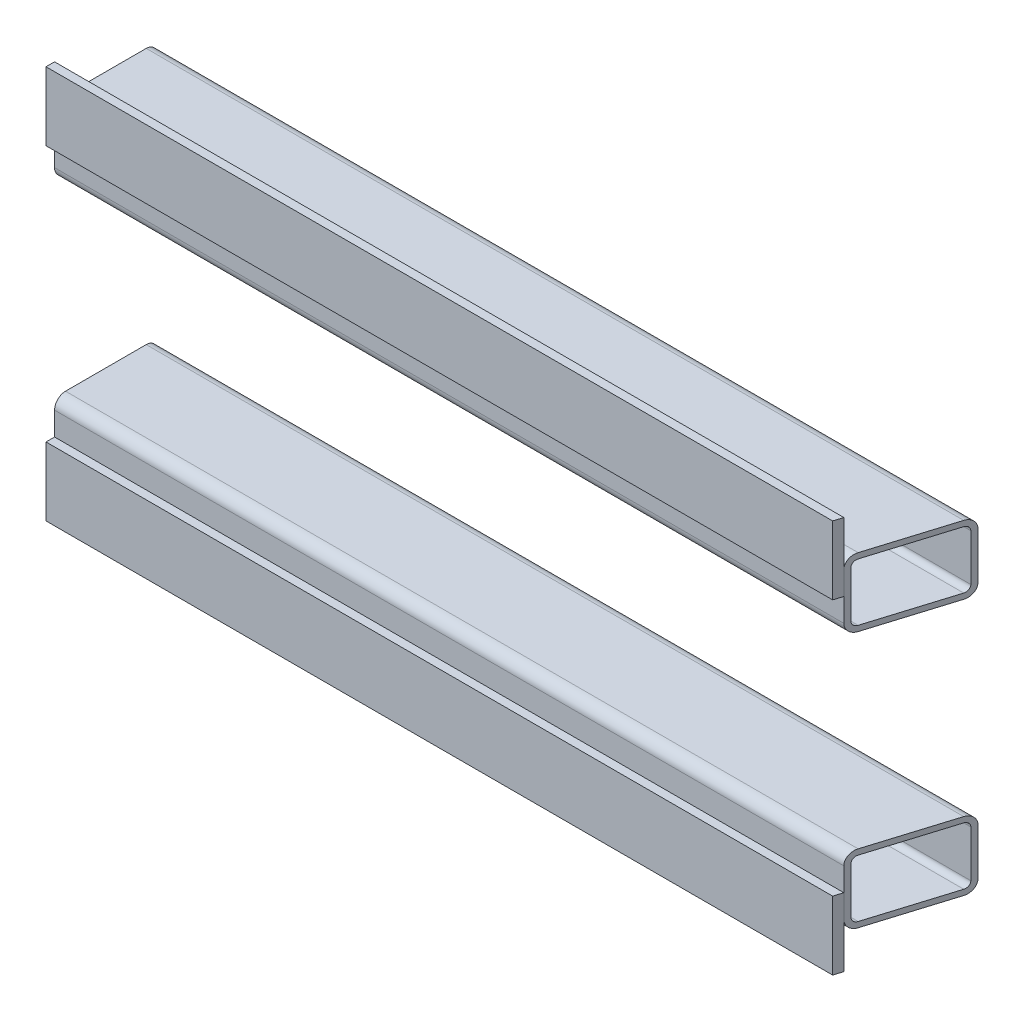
ISO-10303-21;
HEADER;
FILE_DESCRIPTION(('STEP AP214'),'2;1');
FILE_NAME('part.step','',(''),(''),'','','');
FILE_SCHEMA(('AUTOMOTIVE_DESIGN { 1 0 10303 214 1 1 1 1 }'));
ENDSEC;
DATA;
#1=APPLICATION_CONTEXT('core data for automotive mechanical design processes');
#2=APPLICATION_PROTOCOL_DEFINITION('international standard','automotive_design',2000,#1);
#3=PRODUCT_CONTEXT('',#1,'mechanical');
#4=PRODUCT('Part','Part','',(#3));
#5=PRODUCT_RELATED_PRODUCT_CATEGORY('part','',(#4));
#6=PRODUCT_DEFINITION_FORMATION('','',#4);
#7=PRODUCT_DEFINITION_CONTEXT('part definition',#1,'design');
#8=PRODUCT_DEFINITION('design','',#6,#7);
#9=PRODUCT_DEFINITION_SHAPE('','',#8);
#10=(LENGTH_UNIT() NAMED_UNIT(*) SI_UNIT(.MILLI.,.METRE.));
#11=(NAMED_UNIT(*) PLANE_ANGLE_UNIT() SI_UNIT($,.RADIAN.));
#12=(NAMED_UNIT(*) SI_UNIT($,.STERADIAN.) SOLID_ANGLE_UNIT());
#13=UNCERTAINTY_MEASURE_WITH_UNIT(LENGTH_MEASURE(1.E-05),#10,'distance_accuracy_value','');
#14=(GEOMETRIC_REPRESENTATION_CONTEXT(3) GLOBAL_UNCERTAINTY_ASSIGNED_CONTEXT((#13)) GLOBAL_UNIT_ASSIGNED_CONTEXT((#10,
#11,#12)) REPRESENTATION_CONTEXT('',''));
#15=CARTESIAN_POINT('',(0.,0.,0.));
#16=DIRECTION('',(0.,0.,1.));
#17=DIRECTION('',(1.,0.,0.));
#18=AXIS2_PLACEMENT_3D('',#15,#16,#17);
#19=CARTESIAN_POINT('',(-2336.14762409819,-7575.84302061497,60.));
#20=DIRECTION('',(0.,-1.,0.));
#21=DIRECTION('',(1.,0.,0.));
#22=AXIS2_PLACEMENT_3D('',#19,#20,#21);
#23=PLANE('',#22);
#24=DIRECTION('',(-0.294085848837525,0.,0.955779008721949));
#25=VECTOR('',#24,1.);
#26=CARTESIAN_POINT('',(-1856.14762409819,-7575.84302061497,3.52148865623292E-13));
#27=LINE('',#26,#25);
#28=CARTESIAN_POINT('',(-1874.60916255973,-7575.84302061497,60.));
#29=VERTEX_POINT('',#28);
#30=CARTESIAN_POINT('',(-1876.14762409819,-7575.84302061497,65.));
#31=VERTEX_POINT('',#30);
#32=EDGE_CURVE('E62',#29,#31,#27,.T.);
#33=ORIENTED_EDGE('',*,*,#32,.T.);
#34=DIRECTION('',(1.,0.,0.));
#35=VECTOR('',#34,1.);
#36=CARTESIAN_POINT('',(-2336.14762409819,-7575.84302061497,65.));
#37=LINE('',#36,#35);
#38=CARTESIAN_POINT('',(-2336.14762409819,-7575.84302061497,65.));
#39=VERTEX_POINT('',#38);
#40=EDGE_CURVE('E56',#39,#31,#37,.T.);
#41=ORIENTED_EDGE('',*,*,#40,.F.);
#42=DIRECTION('',(0.,0.,-1.));
#43=VECTOR('',#42,1.);
#44=CARTESIAN_POINT('',(-2336.14762409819,-7575.84302061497,60.));
#45=LINE('',#44,#43);
#46=CARTESIAN_POINT('',(-2336.14762409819,-7575.84302061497,60.));
#47=VERTEX_POINT('',#46);
#48=EDGE_CURVE('E114',#39,#47,#45,.T.);
#49=ORIENTED_EDGE('',*,*,#48,.T.);
#50=DIRECTION('',(1.,0.,0.));
#51=VECTOR('',#50,1.);
#52=CARTESIAN_POINT('',(-2336.14762409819,-7575.84302061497,60.));
#53=LINE('',#52,#51);
#54=EDGE_CURVE('E94',#47,#29,#53,.T.);
#55=ORIENTED_EDGE('',*,*,#54,.T.);
#56=EDGE_LOOP('',(#33,#41,#49,#55));
#57=FACE_BOUND('',#56,.T.);
#58=ADVANCED_FACE('F49',(#57),#23,.T.);
#59=CARTESIAN_POINT('',(-2336.14762409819,-7575.84302061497,65.));
#60=DIRECTION('',(0.,0.,1.));
#61=DIRECTION('',(0.,-1.,0.));
#62=AXIS2_PLACEMENT_3D('',#59,#60,#61);
#63=PLANE('',#62);
#64=DIRECTION('',(0.,1.,0.));
#65=VECTOR('',#64,1.);
#66=CARTESIAN_POINT('',(-1876.14762409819,-7575.84302061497,65.));
#67=LINE('',#66,#65);
#68=CARTESIAN_POINT('',(-1876.14762409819,-7535.84302061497,65.));
#69=VERTEX_POINT('',#68);
#70=EDGE_CURVE('E86',#31,#69,#67,.T.);
#71=ORIENTED_EDGE('',*,*,#70,.T.);
#72=DIRECTION('',(1.,0.,0.));
#73=VECTOR('',#72,1.);
#74=CARTESIAN_POINT('',(-2336.14762409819,-7535.84302061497,65.));
#75=LINE('',#74,#73);
#76=CARTESIAN_POINT('',(-2336.14762409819,-7535.84302061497,65.));
#77=VERTEX_POINT('',#76);
#78=EDGE_CURVE('E100',#77,#69,#75,.T.);
#79=ORIENTED_EDGE('',*,*,#78,.F.);
#80=DIRECTION('',(0.,-1.,0.));
#81=VECTOR('',#80,1.);
#82=CARTESIAN_POINT('',(-2336.14762409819,-7575.84302061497,65.));
#83=LINE('',#82,#81);
#84=EDGE_CURVE('E99',#77,#39,#83,.T.);
#85=ORIENTED_EDGE('',*,*,#84,.T.);
#86=ORIENTED_EDGE('',*,*,#40,.T.);
#87=EDGE_LOOP('',(#71,#79,#85,#86));
#88=FACE_BOUND('',#87,.T.);
#89=ADVANCED_FACE('F97',(#88),#63,.T.);
#90=CARTESIAN_POINT('',(-2336.14762409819,-7535.84302061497,60.));
#91=DIRECTION('',(0.,1.,0.));
#92=DIRECTION('',(-1.,0.,0.));
#93=AXIS2_PLACEMENT_3D('',#90,#91,#92);
#94=PLANE('',#93);
#95=DIRECTION('',(-0.294085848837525,0.,0.95577900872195));
#96=VECTOR('',#95,1.);
#97=CARTESIAN_POINT('',(-1914.52600247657,-7535.84302061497,189.729729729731));
#98=LINE('',#97,#96);
#99=CARTESIAN_POINT('',(-1874.60916255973,-7535.84302061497,60.));
#100=VERTEX_POINT('',#99);
#101=EDGE_CURVE('E89',#100,#69,#98,.T.);
#102=ORIENTED_EDGE('',*,*,#101,.F.);
#103=DIRECTION('',(1.,0.,0.));
#104=VECTOR('',#103,1.);
#105=CARTESIAN_POINT('',(-2336.14762409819,-7535.84302061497,60.));
#106=LINE('',#105,#104);
#107=CARTESIAN_POINT('',(-2336.14762409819,-7535.84302061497,60.));
#108=VERTEX_POINT('',#107);
#109=EDGE_CURVE('E102',#108,#100,#106,.T.);
#110=ORIENTED_EDGE('',*,*,#109,.F.);
#111=DIRECTION('',(0.,0.,1.));
#112=VECTOR('',#111,1.);
#113=CARTESIAN_POINT('',(-2336.14762409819,-7535.84302061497,60.));
#114=LINE('',#113,#112);
#115=EDGE_CURVE('E108',#108,#77,#114,.T.);
#116=ORIENTED_EDGE('',*,*,#115,.T.);
#117=ORIENTED_EDGE('',*,*,#78,.T.);
#118=EDGE_LOOP('',(#102,#110,#116,#117));
#119=FACE_BOUND('',#118,.T.);
#120=ADVANCED_FACE('F123',(#119),#94,.T.);
#121=CARTESIAN_POINT('',(-2336.14762409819,-7575.84302061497,60.));
#122=DIRECTION('',(0.,0.,-1.));
#123=DIRECTION('',(0.,1.,0.));
#124=AXIS2_PLACEMENT_3D('',#121,#122,#123);
#125=PLANE('',#124);
#126=DIRECTION('',(0.,1.,0.));
#127=VECTOR('',#126,1.);
#128=CARTESIAN_POINT('',(-1874.60916255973,-7575.84302061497,60.));
#129=LINE('',#128,#127);
#130=EDGE_CURVE('E12',#29,#100,#129,.T.);
#131=ORIENTED_EDGE('',*,*,#130,.F.);
#132=ORIENTED_EDGE('',*,*,#54,.F.);
#133=DIRECTION('',(0.,1.,0.));
#134=VECTOR('',#133,1.);
#135=CARTESIAN_POINT('',(-2336.14762409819,-7575.84302061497,60.));
#136=LINE('',#135,#134);
#137=EDGE_CURVE('E110',#47,#108,#136,.T.);
#138=ORIENTED_EDGE('',*,*,#137,.T.);
#139=ORIENTED_EDGE('',*,*,#109,.T.);
#140=EDGE_LOOP('',(#131,#132,#138,#139));
#141=FACE_BOUND('',#140,.T.);
#142=ADVANCED_FACE('F122',(#141),#125,.T.);
#143=CARTESIAN_POINT('',(-2336.14762409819,-7575.84302061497,65.));
#144=DIRECTION('',(-1.,0.,0.));
#145=DIRECTION('',(0.,0.,1.));
#146=AXIS2_PLACEMENT_3D('',#143,#144,#145);
#147=PLANE('',#146);
#148=ORIENTED_EDGE('',*,*,#48,.F.);
#149=ORIENTED_EDGE('',*,*,#84,.F.);
#150=ORIENTED_EDGE('',*,*,#115,.F.);
#151=ORIENTED_EDGE('',*,*,#137,.F.);
#152=EDGE_LOOP('',(#148,#149,#150,#151));
#153=FACE_BOUND('',#152,.T.);
#154=ADVANCED_FACE('F120',(#153),#147,.T.);
#155=CARTESIAN_POINT('',(-1856.14762409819,-7575.84302061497,3.52148865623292E-13));
#156=DIRECTION('',(-0.95577900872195,0.,-0.294085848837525));
#157=DIRECTION('',(-0.294085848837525,0.,0.95577900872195));
#158=AXIS2_PLACEMENT_3D('',#155,#156,#157);
#159=PLANE('',#158);
#160=ORIENTED_EDGE('',*,*,#101,.T.);
#161=ORIENTED_EDGE('',*,*,#70,.F.);
#162=ORIENTED_EDGE('',*,*,#32,.F.);
#163=ORIENTED_EDGE('',*,*,#130,.T.);
#164=EDGE_LOOP('',(#160,#161,#162,#163));
#165=FACE_BOUND('',#164,.T.);
#166=ADVANCED_FACE('F87',(#165),#159,.F.);
#167=CLOSED_SHELL('',(#58,#89,#120,#142,#154,#166));
#168=MANIFOLD_SOLID_BREP('B2',#167);
#169=CARTESIAN_POINT('',(-2336.14762409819,-7345.84302061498,60.));
#170=DIRECTION('',(0.,0.,-1.));
#171=DIRECTION('',(0.,1.,0.));
#172=AXIS2_PLACEMENT_3D('',#169,#170,#171);
#173=PLANE('',#172);
#174=DIRECTION('',(0.,1.,0.));
#175=VECTOR('',#174,1.);
#176=CARTESIAN_POINT('',(-1874.60916255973,-7345.84302061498,60.));
#177=LINE('',#176,#175);
#178=CARTESIAN_POINT('',(-1874.60916255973,-7385.84302061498,60.));
#179=VERTEX_POINT('',#178);
#180=CARTESIAN_POINT('',(-1874.60916255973,-7345.84302061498,60.));
#181=VERTEX_POINT('',#180);
#182=EDGE_CURVE('E198',#179,#181,#177,.T.);
#183=ORIENTED_EDGE('',*,*,#182,.F.);
#184=DIRECTION('',(1.,0.,0.));
#185=VECTOR('',#184,1.);
#186=CARTESIAN_POINT('',(-2336.14762409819,-7385.84302061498,60.));
#187=LINE('',#186,#185);
#188=CARTESIAN_POINT('',(-2336.14762409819,-7385.84302061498,60.));
#189=VERTEX_POINT('',#188);
#190=EDGE_CURVE('E47',#189,#179,#187,.T.);
#191=ORIENTED_EDGE('',*,*,#190,.F.);
#192=DIRECTION('',(0.,1.,0.));
#193=VECTOR('',#192,1.);
#194=CARTESIAN_POINT('',(-2336.14762409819,-7345.84302061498,60.));
#195=LINE('',#194,#193);
#196=CARTESIAN_POINT('',(-2336.14762409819,-7345.84302061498,60.));
#197=VERTEX_POINT('',#196);
#198=EDGE_CURVE('E249',#189,#197,#195,.T.);
#199=ORIENTED_EDGE('',*,*,#198,.T.);
#200=DIRECTION('',(1.,0.,0.));
#201=VECTOR('',#200,1.);
#202=CARTESIAN_POINT('',(-2336.14762409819,-7345.84302061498,60.));
#203=LINE('',#202,#201);
#204=EDGE_CURVE('E185',#197,#181,#203,.T.);
#205=ORIENTED_EDGE('',*,*,#204,.T.);
#206=EDGE_LOOP('',(#183,#191,#199,#205));
#207=FACE_BOUND('',#206,.T.);
#208=ADVANCED_FACE('F182',(#207),#173,.T.);
#209=CARTESIAN_POINT('',(-2336.14762409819,-7385.84302061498,60.));
#210=DIRECTION('',(0.,-1.,0.));
#211=DIRECTION('',(1.,0.,0.));
#212=AXIS2_PLACEMENT_3D('',#209,#210,#211);
#213=PLANE('',#212);
#214=DIRECTION('',(0.294085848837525,0.,-0.95577900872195));
#215=VECTOR('',#214,1.);
#216=CARTESIAN_POINT('',(-1914.52600247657,-7385.84302061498,189.729729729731));
#217=LINE('',#216,#215);
#218=CARTESIAN_POINT('',(-1876.14762409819,-7385.84302061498,65.));
#219=VERTEX_POINT('',#218);
#220=EDGE_CURVE('E235',#219,#179,#217,.T.);
#221=ORIENTED_EDGE('',*,*,#220,.F.);
#222=DIRECTION('',(1.,0.,0.));
#223=VECTOR('',#222,1.);
#224=CARTESIAN_POINT('',(-2336.14762409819,-7385.84302061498,65.));
#225=LINE('',#224,#223);
#226=CARTESIAN_POINT('',(-2336.14762409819,-7385.84302061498,65.));
#227=VERTEX_POINT('',#226);
#228=EDGE_CURVE('E190',#227,#219,#225,.T.);
#229=ORIENTED_EDGE('',*,*,#228,.F.);
#230=DIRECTION('',(0.,0.,-1.));
#231=VECTOR('',#230,1.);
#232=CARTESIAN_POINT('',(-2336.14762409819,-7385.84302061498,60.));
#233=LINE('',#232,#231);
#234=EDGE_CURVE('E242',#227,#189,#233,.T.);
#235=ORIENTED_EDGE('',*,*,#234,.T.);
#236=ORIENTED_EDGE('',*,*,#190,.T.);
#237=EDGE_LOOP('',(#221,#229,#235,#236));
#238=FACE_BOUND('',#237,.T.);
#239=ADVANCED_FACE('F253',(#238),#213,.T.);
#240=CARTESIAN_POINT('',(-2336.14762409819,-7345.84302061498,65.));
#241=DIRECTION('',(0.,0.,1.));
#242=DIRECTION('',(1.,0.,0.));
#243=AXIS2_PLACEMENT_3D('',#240,#241,#242);
#244=PLANE('',#243);
#245=DIRECTION('',(0.,1.,0.));
#246=VECTOR('',#245,1.);
#247=CARTESIAN_POINT('',(-1876.14762409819,-7575.84302061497,65.));
#248=LINE('',#247,#246);
#249=CARTESIAN_POINT('',(-1876.14762409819,-7345.84302061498,65.));
#250=VERTEX_POINT('',#249);
#251=EDGE_CURVE('E223',#219,#250,#248,.T.);
#252=ORIENTED_EDGE('',*,*,#251,.T.);
#253=DIRECTION('',(1.,0.,0.));
#254=VECTOR('',#253,1.);
#255=CARTESIAN_POINT('',(-2336.14762409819,-7345.84302061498,65.));
#256=LINE('',#255,#254);
#257=CARTESIAN_POINT('',(-2336.14762409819,-7345.84302061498,65.));
#258=VERTEX_POINT('',#257);
#259=EDGE_CURVE('E233',#258,#250,#256,.T.);
#260=ORIENTED_EDGE('',*,*,#259,.F.);
#261=DIRECTION('',(0.,-1.,0.));
#262=VECTOR('',#261,1.);
#263=CARTESIAN_POINT('',(-2336.14762409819,-7345.84302061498,65.));
#264=LINE('',#263,#262);
#265=EDGE_CURVE('E246',#258,#227,#264,.T.);
#266=ORIENTED_EDGE('',*,*,#265,.T.);
#267=ORIENTED_EDGE('',*,*,#228,.T.);
#268=EDGE_LOOP('',(#252,#260,#266,#267));
#269=FACE_BOUND('',#268,.T.);
#270=ADVANCED_FACE('F231',(#269),#244,.T.);
#271=CARTESIAN_POINT('',(-2336.14762409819,-7345.84302061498,60.));
#272=DIRECTION('',(0.,1.,0.));
#273=DIRECTION('',(-1.,0.,0.));
#274=AXIS2_PLACEMENT_3D('',#271,#272,#273);
#275=PLANE('',#274);
#276=DIRECTION('',(-0.294085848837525,0.,0.955779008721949));
#277=VECTOR('',#276,1.);
#278=CARTESIAN_POINT('',(-1856.14762409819,-7345.84302061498,3.52148865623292E-13));
#279=LINE('',#278,#277);
#280=EDGE_CURVE('E220',#181,#250,#279,.T.);
#281=ORIENTED_EDGE('',*,*,#280,.F.);
#282=ORIENTED_EDGE('',*,*,#204,.F.);
#283=DIRECTION('',(0.,0.,1.));
#284=VECTOR('',#283,1.);
#285=CARTESIAN_POINT('',(-2336.14762409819,-7345.84302061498,60.));
#286=LINE('',#285,#284);
#287=EDGE_CURVE('E240',#197,#258,#286,.T.);
#288=ORIENTED_EDGE('',*,*,#287,.T.);
#289=ORIENTED_EDGE('',*,*,#259,.T.);
#290=EDGE_LOOP('',(#281,#282,#288,#289));
#291=FACE_BOUND('',#290,.T.);
#292=ADVANCED_FACE('F238',(#291),#275,.T.);
#293=CARTESIAN_POINT('',(-2336.14762409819,-7385.84302061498,60.));
#294=DIRECTION('',(-1.,0.,0.));
#295=DIRECTION('',(0.,0.,1.));
#296=AXIS2_PLACEMENT_3D('',#293,#294,#295);
#297=PLANE('',#296);
#298=ORIENTED_EDGE('',*,*,#198,.F.);
#299=ORIENTED_EDGE('',*,*,#234,.F.);
#300=ORIENTED_EDGE('',*,*,#265,.F.);
#301=ORIENTED_EDGE('',*,*,#287,.F.);
#302=EDGE_LOOP('',(#298,#299,#300,#301));
#303=FACE_BOUND('',#302,.T.);
#304=ADVANCED_FACE('F256',(#303),#297,.T.);
#305=CARTESIAN_POINT('',(-1856.14762409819,-7575.84302061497,3.52148865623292E-13));
#306=DIRECTION('',(-0.95577900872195,0.,-0.294085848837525));
#307=DIRECTION('',(-0.294085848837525,0.,0.95577900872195));
#308=AXIS2_PLACEMENT_3D('',#305,#306,#307);
#309=PLANE('',#308);
#310=ORIENTED_EDGE('',*,*,#182,.T.);
#311=ORIENTED_EDGE('',*,*,#280,.T.);
#312=ORIENTED_EDGE('',*,*,#251,.F.);
#313=ORIENTED_EDGE('',*,*,#220,.T.);
#314=EDGE_LOOP('',(#310,#311,#312,#313));
#315=FACE_BOUND('',#314,.T.);
#316=ADVANCED_FACE('F222',(#315),#309,.F.);
#317=CLOSED_SHELL('',(#208,#239,#270,#292,#304,#316));
#318=MANIFOLD_SOLID_BREP('B6',#317);
#319=CARTESIAN_POINT('',(-1856.14762409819,-7522.24302061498,53.6));
#320=DIRECTION('',(-1.,0.,0.));
#321=DIRECTION('',(0.,0.,1.));
#322=AXIS2_PLACEMENT_3D('',#319,#320,#321);
#323=CYLINDRICAL_SURFACE('',#322,6.39999999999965);
#324=DIRECTION('',(-1.,0.,0.));
#325=VECTOR('',#324,1.);
#326=CARTESIAN_POINT('',(-1856.14762409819,-7522.24302061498,60.));
#327=LINE('',#326,#325);
#328=CARTESIAN_POINT('',(-1874.60916255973,-7522.24302061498,60.));
#329=VERTEX_POINT('',#328);
#330=CARTESIAN_POINT('',(-2336.14762409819,-7522.24302061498,60.));
#331=VERTEX_POINT('',#330);
#332=EDGE_CURVE('E180',#329,#331,#327,.T.);
#333=ORIENTED_EDGE('',*,*,#332,.F.);
#334=CARTESIAN_POINT('',(-1872.6399317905,-7522.24302061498,53.6));
#335=DIRECTION('',(-0.95577900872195,0.,-0.294085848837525));
#336=DIRECTION('',(-0.294085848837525,0.,0.95577900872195));
#337=AXIS2_PLACEMENT_3D('',#334,#335,#336);
#338=ELLIPSE('',#337,6.69610855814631,6.39999999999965);
#339=CARTESIAN_POINT('',(-1872.6399317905,-7515.84302061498,53.6));
#340=VERTEX_POINT('',#339);
#341=EDGE_CURVE('E531',#329,#340,#338,.T.);
#342=ORIENTED_EDGE('',*,*,#341,.T.);
#343=DIRECTION('',(-1.,0.,0.));
#344=VECTOR('',#343,1.);
#345=CARTESIAN_POINT('',(-1856.14762409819,-7515.84302061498,53.6));
#346=LINE('',#345,#344);
#347=CARTESIAN_POINT('',(-2336.14762409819,-7515.84302061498,53.6));
#348=VERTEX_POINT('',#347);
#349=EDGE_CURVE('E407',#340,#348,#346,.T.);
#350=ORIENTED_EDGE('',*,*,#349,.T.);
#351=CARTESIAN_POINT('',(-2336.14762409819,-7522.24302061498,53.6));
#352=DIRECTION('',(1.,0.,0.));
#353=DIRECTION('',(0.,0.,-1.));
#354=AXIS2_PLACEMENT_3D('',#351,#352,#353);
#355=CIRCLE('',#354,6.39999999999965);
#356=EDGE_CURVE('E421',#348,#331,#355,.T.);
#357=ORIENTED_EDGE('',*,*,#356,.T.);
#358=EDGE_LOOP('',(#333,#342,#350,#357));
#359=FACE_BOUND('',#358,.T.);
#360=ADVANCED_FACE('F314',(#359),#323,.T.);
#361=CARTESIAN_POINT('',(-1856.14762409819,-7522.24302061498,60.));
#362=DIRECTION('',(0.,0.,-1.));
#363=DIRECTION('',(-1.,0.,0.));
#364=AXIS2_PLACEMENT_3D('',#361,#362,#363);
#365=PLANE('',#364);
#366=DIRECTION('',(-1.,0.,0.));
#367=VECTOR('',#366,1.);
#368=CARTESIAN_POINT('',(-1856.14762409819,-7549.44302061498,59.9999999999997));
#369=LINE('',#368,#367);
#370=CARTESIAN_POINT('',(-1874.60916255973,-7549.44302061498,60.));
#371=VERTEX_POINT('',#370);
#372=CARTESIAN_POINT('',(-2336.14762409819,-7549.44302061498,59.9999999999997));
#373=VERTEX_POINT('',#372);
#374=EDGE_CURVE('E323',#371,#373,#369,.T.);
#375=ORIENTED_EDGE('',*,*,#374,.F.);
#376=DIRECTION('',(0.,1.,0.));
#377=VECTOR('',#376,1.);
#378=CARTESIAN_POINT('',(-1874.60916255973,-7522.24302061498,60.));
#379=LINE('',#378,#377);
#380=EDGE_CURVE('E577',#371,#329,#379,.T.);
#381=ORIENTED_EDGE('',*,*,#380,.T.);
#382=ORIENTED_EDGE('',*,*,#332,.T.);
#383=DIRECTION('',(0.,-1.,0.));
#384=VECTOR('',#383,1.);
#385=CARTESIAN_POINT('',(-2336.14762409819,-7522.24302061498,60.));
#386=LINE('',#385,#384);
#387=EDGE_CURVE('E493',#331,#373,#386,.T.);
#388=ORIENTED_EDGE('',*,*,#387,.T.);
#389=EDGE_LOOP('',(#375,#381,#382,#388));
#390=FACE_BOUND('',#389,.T.);
#391=ADVANCED_FACE('F590',(#390),#365,.F.);
#392=CARTESIAN_POINT('',(-1856.14762409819,-7549.44302061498,53.6));
#393=DIRECTION('',(-1.,0.,0.));
#394=DIRECTION('',(0.,0.,1.));
#395=AXIS2_PLACEMENT_3D('',#392,#393,#394);
#396=CYLINDRICAL_SURFACE('',#395,6.39999999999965);
#397=DIRECTION('',(-1.,0.,0.));
#398=VECTOR('',#397,1.);
#399=CARTESIAN_POINT('',(-1856.14762409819,-7555.84302061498,53.6));
#400=LINE('',#399,#398);
#401=CARTESIAN_POINT('',(-1872.6399317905,-7555.84302061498,53.6));
#402=VERTEX_POINT('',#401);
#403=CARTESIAN_POINT('',(-2336.14762409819,-7555.84302061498,53.6));
#404=VERTEX_POINT('',#403);
#405=EDGE_CURVE('E435',#402,#404,#400,.T.);
#406=ORIENTED_EDGE('',*,*,#405,.F.);
#407=CARTESIAN_POINT('',(-1872.6399317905,-7549.44302061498,53.6));
#408=DIRECTION('',(-0.95577900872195,0.,-0.294085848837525));
#409=DIRECTION('',(-0.294085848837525,0.,0.95577900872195));
#410=AXIS2_PLACEMENT_3D('',#407,#408,#409);
#411=ELLIPSE('',#410,6.69610855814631,6.39999999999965);
#412=EDGE_CURVE('E575',#402,#371,#411,.T.);
#413=ORIENTED_EDGE('',*,*,#412,.T.);
#414=ORIENTED_EDGE('',*,*,#374,.T.);
#415=CARTESIAN_POINT('',(-2336.14762409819,-7549.44302061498,53.6));
#416=DIRECTION('',(1.,0.,0.));
#417=DIRECTION('',(0.,0.,-1.));
#418=AXIS2_PLACEMENT_3D('',#415,#416,#417);
#419=CIRCLE('',#418,6.39999999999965);
#420=EDGE_CURVE('E496',#373,#404,#419,.T.);
#421=ORIENTED_EDGE('',*,*,#420,.T.);
#422=EDGE_LOOP('',(#406,#413,#414,#421));
#423=FACE_BOUND('',#422,.T.);
#424=ADVANCED_FACE('F522',(#423),#396,.T.);
#425=CARTESIAN_POINT('',(-1856.14762409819,-7555.84302061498,6.4));
#426=DIRECTION('',(0.,1.,0.));
#427=DIRECTION('',(0.,0.,1.));
#428=AXIS2_PLACEMENT_3D('',#425,#426,#427);
#429=PLANE('',#428);
#430=DIRECTION('',(-1.,0.,0.));
#431=VECTOR('',#430,1.);
#432=CARTESIAN_POINT('',(-1856.14762409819,-7555.84302061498,6.4));
#433=LINE('',#432,#431);
#434=CARTESIAN_POINT('',(-1858.11685486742,-7555.84302061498,6.4));
#435=VERTEX_POINT('',#434);
#436=CARTESIAN_POINT('',(-2336.14762409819,-7555.84302061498,6.4));
#437=VERTEX_POINT('',#436);
#438=EDGE_CURVE('E433',#435,#437,#433,.T.);
#439=ORIENTED_EDGE('',*,*,#438,.F.);
#440=DIRECTION('',(-0.294085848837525,0.,0.95577900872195));
#441=VECTOR('',#440,1.);
#442=CARTESIAN_POINT('',(-1857.94654301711,-7555.84302061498,5.84648648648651));
#443=LINE('',#442,#441);
#444=EDGE_CURVE('E519',#435,#402,#443,.T.);
#445=ORIENTED_EDGE('',*,*,#444,.T.);
#446=ORIENTED_EDGE('',*,*,#405,.T.);
#447=DIRECTION('',(0.,0.,-1.));
#448=VECTOR('',#447,1.);
#449=CARTESIAN_POINT('',(-2336.14762409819,-7555.84302061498,6.4));
#450=LINE('',#449,#448);
#451=EDGE_CURVE('E499',#404,#437,#450,.T.);
#452=ORIENTED_EDGE('',*,*,#451,.T.);
#453=EDGE_LOOP('',(#439,#445,#446,#452));
#454=FACE_BOUND('',#453,.T.);
#455=ADVANCED_FACE('F516',(#454),#429,.F.);
#456=CARTESIAN_POINT('',(-1856.14762409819,-7549.44302061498,6.4));
#457=DIRECTION('',(-1.,0.,0.));
#458=DIRECTION('',(0.,0.,1.));
#459=AXIS2_PLACEMENT_3D('',#456,#457,#458);
#460=CYLINDRICAL_SURFACE('',#459,6.39999999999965);
#461=DIRECTION('',(-1.,0.,0.));
#462=VECTOR('',#461,1.);
#463=CARTESIAN_POINT('',(-1856.14762409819,-7549.44302061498,0.));
#464=LINE('',#463,#462);
#465=CARTESIAN_POINT('',(-1856.14762409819,-7549.44302061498,0.));
#466=VERTEX_POINT('',#465);
#467=CARTESIAN_POINT('',(-2336.14762409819,-7549.44302061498,0.));
#468=VERTEX_POINT('',#467);
#469=EDGE_CURVE('E430',#466,#468,#464,.T.);
#470=ORIENTED_EDGE('',*,*,#469,.F.);
#471=CARTESIAN_POINT('',(-1858.11685486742,-7549.44302061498,6.4));
#472=DIRECTION('',(-0.95577900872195,0.,-0.294085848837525));
#473=DIRECTION('',(-0.294085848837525,0.,0.95577900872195));
#474=AXIS2_PLACEMENT_3D('',#471,#472,#473);
#475=ELLIPSE('',#474,6.69610855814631,6.39999999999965);
#476=EDGE_CURVE('E340',#466,#435,#475,.T.);
#477=ORIENTED_EDGE('',*,*,#476,.T.);
#478=ORIENTED_EDGE('',*,*,#438,.T.);
#479=CARTESIAN_POINT('',(-2336.14762409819,-7549.44302061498,6.4));
#480=DIRECTION('',(1.,0.,0.));
#481=DIRECTION('',(0.,0.,-1.));
#482=AXIS2_PLACEMENT_3D('',#479,#480,#481);
#483=CIRCLE('',#482,6.39999999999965);
#484=EDGE_CURVE('E502',#437,#468,#483,.T.);
#485=ORIENTED_EDGE('',*,*,#484,.T.);
#486=EDGE_LOOP('',(#470,#477,#478,#485));
#487=FACE_BOUND('',#486,.T.);
#488=ADVANCED_FACE('F511',(#487),#460,.T.);
#489=CARTESIAN_POINT('',(-1856.14762409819,-7549.44302061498,0.));
#490=DIRECTION('',(0.,0.,1.));
#491=DIRECTION('',(1.,0.,0.));
#492=AXIS2_PLACEMENT_3D('',#489,#490,#491);
#493=PLANE('',#492);
#494=DIRECTION('',(0.,1.,0.));
#495=VECTOR('',#494,1.);
#496=CARTESIAN_POINT('',(-2336.14762409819,-7549.44302061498,0.));
#497=LINE('',#496,#495);
#498=CARTESIAN_POINT('',(-2336.14762409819,-7522.24302061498,3.55618312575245E-13));
#499=VERTEX_POINT('',#498);
#500=EDGE_CURVE('E416',#468,#499,#497,.T.);
#501=ORIENTED_EDGE('',*,*,#500,.T.);
#502=DIRECTION('',(-1.,0.,0.));
#503=VECTOR('',#502,1.);
#504=CARTESIAN_POINT('',(-1856.14762409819,-7522.24302061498,3.55618312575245E-13));
#505=LINE('',#504,#503);
#506=CARTESIAN_POINT('',(-1856.14762409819,-7522.24302061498,3.52148865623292E-13));
#507=VERTEX_POINT('',#506);
#508=EDGE_CURVE('E406',#507,#499,#505,.T.);
#509=ORIENTED_EDGE('',*,*,#508,.F.);
#510=DIRECTION('',(0.,1.,0.));
#511=VECTOR('',#510,1.);
#512=CARTESIAN_POINT('',(-1856.14762409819,-7549.44302061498,0.));
#513=LINE('',#512,#511);
#514=EDGE_CURVE('E422',#466,#507,#513,.T.);
#515=ORIENTED_EDGE('',*,*,#514,.F.);
#516=ORIENTED_EDGE('',*,*,#469,.T.);
#517=EDGE_LOOP('',(#501,#509,#515,#516));
#518=FACE_BOUND('',#517,.T.);
#519=ADVANCED_FACE('F504',(#518),#493,.F.);
#520=CARTESIAN_POINT('',(-1856.14762409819,-7522.24302061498,6.4));
#521=DIRECTION('',(-1.,0.,0.));
#522=DIRECTION('',(0.,0.,1.));
#523=AXIS2_PLACEMENT_3D('',#520,#521,#522);
#524=CYLINDRICAL_SURFACE('',#523,6.39999999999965);
#525=DIRECTION('',(-1.,0.,0.));
#526=VECTOR('',#525,1.);
#527=CARTESIAN_POINT('',(-1856.14762409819,-7515.84302061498,6.4));
#528=LINE('',#527,#526);
#529=CARTESIAN_POINT('',(-1858.11685486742,-7515.84302061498,6.4));
#530=VERTEX_POINT('',#529);
#531=CARTESIAN_POINT('',(-2336.14762409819,-7515.84302061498,6.4));
#532=VERTEX_POINT('',#531);
#533=EDGE_CURVE('E394',#530,#532,#528,.T.);
#534=ORIENTED_EDGE('',*,*,#533,.F.);
#535=CARTESIAN_POINT('',(-1858.11685486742,-7522.24302061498,6.4));
#536=DIRECTION('',(-0.95577900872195,0.,-0.294085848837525));
#537=DIRECTION('',(-0.294085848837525,0.,0.95577900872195));
#538=AXIS2_PLACEMENT_3D('',#535,#536,#537);
#539=ELLIPSE('',#538,6.69610855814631,6.39999999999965);
#540=EDGE_CURVE('E581',#530,#507,#539,.T.);
#541=ORIENTED_EDGE('',*,*,#540,.T.);
#542=ORIENTED_EDGE('',*,*,#508,.T.);
#543=CARTESIAN_POINT('',(-2336.14762409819,-7522.24302061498,6.4));
#544=DIRECTION('',(1.,0.,0.));
#545=DIRECTION('',(0.,0.,-1.));
#546=AXIS2_PLACEMENT_3D('',#543,#544,#545);
#547=CIRCLE('',#546,6.39999999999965);
#548=EDGE_CURVE('E411',#499,#532,#547,.T.);
#549=ORIENTED_EDGE('',*,*,#548,.T.);
#550=EDGE_LOOP('',(#534,#541,#542,#549));
#551=FACE_BOUND('',#550,.T.);
#552=ADVANCED_FACE('F412',(#551),#524,.T.);
#553=CARTESIAN_POINT('',(-1856.14762409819,-7549.44302061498,53.6));
#554=DIRECTION('',(-1.,0.,0.));
#555=DIRECTION('',(0.,0.,1.));
#556=AXIS2_PLACEMENT_3D('',#553,#554,#555);
#557=CYLINDRICAL_SURFACE('',#556,3.19999999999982);
#558=CARTESIAN_POINT('',(-1872.6399317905,-7549.44302061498,53.6));
#559=DIRECTION('',(-0.95577900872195,0.,-0.294085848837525));
#560=DIRECTION('',(-0.294085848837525,0.,0.95577900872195));
#561=AXIS2_PLACEMENT_3D('',#558,#559,#560);
#562=ELLIPSE('',#561,3.34805427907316,3.19999999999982);
#563=CARTESIAN_POINT('',(-1872.6399317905,-7552.64302061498,53.6));
#564=VERTEX_POINT('',#563);
#565=CARTESIAN_POINT('',(-1873.62454717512,-7549.44302061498,56.8));
#566=VERTEX_POINT('',#565);
#567=EDGE_CURVE('E472',#564,#566,#562,.T.);
#568=ORIENTED_EDGE('',*,*,#567,.F.);
#569=DIRECTION('',(-1.,0.,0.));
#570=VECTOR('',#569,1.);
#571=CARTESIAN_POINT('',(-1856.14762409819,-7552.64302061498,53.6));
#572=LINE('',#571,#570);
#573=CARTESIAN_POINT('',(-2336.14762409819,-7552.64302061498,53.6));
#574=VERTEX_POINT('',#573);
#575=EDGE_CURVE('E424',#564,#574,#572,.T.);
#576=ORIENTED_EDGE('',*,*,#575,.T.);
#577=CARTESIAN_POINT('',(-2336.14762409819,-7549.44302061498,53.6));
#578=DIRECTION('',(1.,0.,0.));
#579=DIRECTION('',(0.,0.,-1.));
#580=AXIS2_PLACEMENT_3D('',#577,#578,#579);
#581=CIRCLE('',#580,3.19999999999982);
#582=CARTESIAN_POINT('',(-2336.14762409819,-7549.44302061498,56.8));
#583=VERTEX_POINT('',#582);
#584=EDGE_CURVE('E467',#583,#574,#581,.T.);
#585=ORIENTED_EDGE('',*,*,#584,.F.);
#586=DIRECTION('',(-1.,0.,0.));
#587=VECTOR('',#586,1.);
#588=CARTESIAN_POINT('',(-1856.14762409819,-7549.44302061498,56.8));
#589=LINE('',#588,#587);
#590=EDGE_CURVE('E318',#566,#583,#589,.T.);
#591=ORIENTED_EDGE('',*,*,#590,.F.);
#592=EDGE_LOOP('',(#568,#576,#585,#591));
#593=FACE_BOUND('',#592,.T.);
#594=ADVANCED_FACE('F316',(#593),#557,.F.);
#595=CARTESIAN_POINT('',(-1856.14762409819,-7522.24302061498,56.8));
#596=DIRECTION('',(0.,0.,-1.));
#597=DIRECTION('',(-1.,0.,0.));
#598=AXIS2_PLACEMENT_3D('',#595,#596,#597);
#599=PLANE('',#598);
#600=DIRECTION('',(0.,1.,0.));
#601=VECTOR('',#600,1.);
#602=CARTESIAN_POINT('',(-1873.62454717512,-7522.24302061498,56.8));
#603=LINE('',#602,#601);
#604=CARTESIAN_POINT('',(-1873.62454717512,-7522.24302061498,56.8));
#605=VERTEX_POINT('',#604);
#606=EDGE_CURVE('E463',#566,#605,#603,.T.);
#607=ORIENTED_EDGE('',*,*,#606,.F.);
#608=ORIENTED_EDGE('',*,*,#590,.T.);
#609=DIRECTION('',(0.,-1.,0.));
#610=VECTOR('',#609,1.);
#611=CARTESIAN_POINT('',(-2336.14762409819,-7522.24302061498,56.8));
#612=LINE('',#611,#610);
#613=CARTESIAN_POINT('',(-2336.14762409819,-7522.24302061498,56.8));
#614=VERTEX_POINT('',#613);
#615=EDGE_CURVE('E460',#614,#583,#612,.T.);
#616=ORIENTED_EDGE('',*,*,#615,.F.);
#617=DIRECTION('',(-1.,0.,0.));
#618=VECTOR('',#617,1.);
#619=CARTESIAN_POINT('',(-1856.14762409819,-7522.24302061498,56.8));
#620=LINE('',#619,#618);
#621=EDGE_CURVE('E448',#605,#614,#620,.T.);
#622=ORIENTED_EDGE('',*,*,#621,.F.);
#623=EDGE_LOOP('',(#607,#608,#616,#622));
#624=FACE_BOUND('',#623,.T.);
#625=ADVANCED_FACE('F458',(#624),#599,.T.);
#626=CARTESIAN_POINT('',(-1856.14762409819,-7522.24302061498,53.6));
#627=DIRECTION('',(-1.,0.,0.));
#628=DIRECTION('',(0.,0.,1.));
#629=AXIS2_PLACEMENT_3D('',#626,#627,#628);
#630=CYLINDRICAL_SURFACE('',#629,3.19999999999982);
#631=CARTESIAN_POINT('',(-1872.6399317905,-7522.24302061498,53.6));
#632=DIRECTION('',(-0.95577900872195,0.,-0.294085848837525));
#633=DIRECTION('',(-0.294085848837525,0.,0.95577900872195));
#634=AXIS2_PLACEMENT_3D('',#631,#632,#633);
#635=ELLIPSE('',#634,3.34805427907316,3.19999999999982);
#636=CARTESIAN_POINT('',(-1872.6399317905,-7519.04302061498,53.6));
#637=VERTEX_POINT('',#636);
#638=EDGE_CURVE('E561',#605,#637,#635,.T.);
#639=ORIENTED_EDGE('',*,*,#638,.F.);
#640=ORIENTED_EDGE('',*,*,#621,.T.);
#641=CARTESIAN_POINT('',(-2336.14762409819,-7522.24302061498,53.6));
#642=DIRECTION('',(1.,0.,0.));
#643=DIRECTION('',(0.,0.,-1.));
#644=AXIS2_PLACEMENT_3D('',#641,#642,#643);
#645=CIRCLE('',#644,3.19999999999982);
#646=CARTESIAN_POINT('',(-2336.14762409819,-7519.04302061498,53.6));
#647=VERTEX_POINT('',#646);
#648=EDGE_CURVE('E475',#647,#614,#645,.T.);
#649=ORIENTED_EDGE('',*,*,#648,.F.);
#650=DIRECTION('',(-1.,0.,0.));
#651=VECTOR('',#650,1.);
#652=CARTESIAN_POINT('',(-1856.14762409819,-7519.04302061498,53.6));
#653=LINE('',#652,#651);
#654=EDGE_CURVE('E447',#637,#647,#653,.T.);
#655=ORIENTED_EDGE('',*,*,#654,.F.);
#656=EDGE_LOOP('',(#639,#640,#649,#655));
#657=FACE_BOUND('',#656,.T.);
#658=ADVANCED_FACE('F617',(#657),#630,.F.);
#659=CARTESIAN_POINT('',(-1856.14762409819,-7519.04302061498,53.6));
#660=DIRECTION('',(0.,-1.,0.));
#661=DIRECTION('',(0.,0.,-1.));
#662=AXIS2_PLACEMENT_3D('',#659,#660,#661);
#663=PLANE('',#662);
#664=DIRECTION('',(0.294085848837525,0.,-0.95577900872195));
#665=VECTOR('',#664,1.);
#666=CARTESIAN_POINT('',(-1871.21357004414,-7519.04302061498,48.9643243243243));
#667=LINE('',#666,#665);
#668=CARTESIAN_POINT('',(-1858.11685486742,-7519.04302061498,6.4));
#669=VERTEX_POINT('',#668);
#670=EDGE_CURVE('E565',#637,#669,#667,.T.);
#671=ORIENTED_EDGE('',*,*,#670,.F.);
#672=ORIENTED_EDGE('',*,*,#654,.T.);
#673=DIRECTION('',(0.,0.,1.));
#674=VECTOR('',#673,1.);
#675=CARTESIAN_POINT('',(-2336.14762409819,-7519.04302061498,53.6));
#676=LINE('',#675,#674);
#677=CARTESIAN_POINT('',(-2336.14762409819,-7519.04302061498,6.4));
#678=VERTEX_POINT('',#677);
#679=EDGE_CURVE('E477',#678,#647,#676,.T.);
#680=ORIENTED_EDGE('',*,*,#679,.F.);
#681=DIRECTION('',(-1.,0.,0.));
#682=VECTOR('',#681,1.);
#683=CARTESIAN_POINT('',(-1856.14762409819,-7519.04302061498,6.4));
#684=LINE('',#683,#682);
#685=EDGE_CURVE('E445',#669,#678,#684,.T.);
#686=ORIENTED_EDGE('',*,*,#685,.F.);
#687=EDGE_LOOP('',(#671,#672,#680,#686));
#688=FACE_BOUND('',#687,.T.);
#689=ADVANCED_FACE('F613',(#688),#663,.T.);
#690=CARTESIAN_POINT('',(-1856.14762409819,-7522.24302061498,6.4));
#691=DIRECTION('',(-1.,0.,0.));
#692=DIRECTION('',(0.,0.,1.));
#693=AXIS2_PLACEMENT_3D('',#690,#691,#692);
#694=CYLINDRICAL_SURFACE('',#693,3.19999999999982);
#695=CARTESIAN_POINT('',(-1858.11685486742,-7522.24302061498,6.4));
#696=DIRECTION('',(-0.95577900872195,0.,-0.294085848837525));
#697=DIRECTION('',(-0.294085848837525,0.,0.95577900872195));
#698=AXIS2_PLACEMENT_3D('',#695,#696,#697);
#699=ELLIPSE('',#698,3.34805427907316,3.19999999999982);
#700=CARTESIAN_POINT('',(-1857.13223948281,-7522.24302061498,3.2));
#701=VERTEX_POINT('',#700);
#702=EDGE_CURVE('E567',#669,#701,#699,.T.);
#703=ORIENTED_EDGE('',*,*,#702,.F.);
#704=ORIENTED_EDGE('',*,*,#685,.T.);
#705=CARTESIAN_POINT('',(-2336.14762409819,-7522.24302061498,6.4));
#706=DIRECTION('',(1.,0.,0.));
#707=DIRECTION('',(0.,0.,-1.));
#708=AXIS2_PLACEMENT_3D('',#705,#706,#707);
#709=CIRCLE('',#708,3.19999999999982);
#710=CARTESIAN_POINT('',(-2336.14762409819,-7522.24302061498,3.20000000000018));
#711=VERTEX_POINT('',#710);
#712=EDGE_CURVE('E481',#711,#678,#709,.T.);
#713=ORIENTED_EDGE('',*,*,#712,.F.);
#714=DIRECTION('',(-1.,0.,0.));
#715=VECTOR('',#714,1.);
#716=CARTESIAN_POINT('',(-1856.14762409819,-7522.24302061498,3.20000000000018));
#717=LINE('',#716,#715);
#718=EDGE_CURVE('E443',#701,#711,#717,.T.);
#719=ORIENTED_EDGE('',*,*,#718,.F.);
#720=EDGE_LOOP('',(#703,#704,#713,#719));
#721=FACE_BOUND('',#720,.T.);
#722=ADVANCED_FACE('F609',(#721),#694,.F.);
#723=CARTESIAN_POINT('',(-1856.14762409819,-7549.44302061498,3.2));
#724=DIRECTION('',(0.,0.,1.));
#725=DIRECTION('',(1.,0.,0.));
#726=AXIS2_PLACEMENT_3D('',#723,#724,#725);
#727=PLANE('',#726);
#728=DIRECTION('',(0.,-1.,0.));
#729=VECTOR('',#728,1.);
#730=CARTESIAN_POINT('',(-1857.13223948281,-7549.44302061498,3.2));
#731=LINE('',#730,#729);
#732=CARTESIAN_POINT('',(-1857.13223948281,-7549.44302061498,3.2));
#733=VERTEX_POINT('',#732);
#734=EDGE_CURVE('E569',#701,#733,#731,.T.);
#735=ORIENTED_EDGE('',*,*,#734,.F.);
#736=ORIENTED_EDGE('',*,*,#718,.T.);
#737=DIRECTION('',(0.,1.,0.));
#738=VECTOR('',#737,1.);
#739=CARTESIAN_POINT('',(-2336.14762409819,-7549.44302061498,3.2));
#740=LINE('',#739,#738);
#741=CARTESIAN_POINT('',(-2336.14762409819,-7549.44302061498,3.2));
#742=VERTEX_POINT('',#741);
#743=EDGE_CURVE('E484',#742,#711,#740,.T.);
#744=ORIENTED_EDGE('',*,*,#743,.F.);
#745=DIRECTION('',(-1.,0.,0.));
#746=VECTOR('',#745,1.);
#747=CARTESIAN_POINT('',(-1856.14762409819,-7549.44302061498,3.2));
#748=LINE('',#747,#746);
#749=EDGE_CURVE('E441',#733,#742,#748,.T.);
#750=ORIENTED_EDGE('',*,*,#749,.F.);
#751=EDGE_LOOP('',(#735,#736,#744,#750));
#752=FACE_BOUND('',#751,.T.);
#753=ADVANCED_FACE('F605',(#752),#727,.T.);
#754=CARTESIAN_POINT('',(-1856.14762409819,-7549.44302061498,6.4));
#755=DIRECTION('',(-1.,0.,0.));
#756=DIRECTION('',(0.,0.,1.));
#757=AXIS2_PLACEMENT_3D('',#754,#755,#756);
#758=CYLINDRICAL_SURFACE('',#757,3.19999999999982);
#759=CARTESIAN_POINT('',(-1858.11685486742,-7549.44302061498,6.4));
#760=DIRECTION('',(-0.95577900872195,0.,-0.294085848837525));
#761=DIRECTION('',(-0.294085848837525,0.,0.95577900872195));
#762=AXIS2_PLACEMENT_3D('',#759,#760,#761);
#763=ELLIPSE('',#762,3.34805427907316,3.19999999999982);
#764=CARTESIAN_POINT('',(-1858.11685486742,-7552.64302061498,6.4));
#765=VERTEX_POINT('',#764);
#766=EDGE_CURVE('E331',#733,#765,#763,.T.);
#767=ORIENTED_EDGE('',*,*,#766,.F.);
#768=ORIENTED_EDGE('',*,*,#749,.T.);
#769=CARTESIAN_POINT('',(-2336.14762409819,-7549.44302061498,6.4));
#770=DIRECTION('',(1.,0.,0.));
#771=DIRECTION('',(0.,0.,-1.));
#772=AXIS2_PLACEMENT_3D('',#769,#770,#771);
#773=CIRCLE('',#772,3.19999999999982);
#774=CARTESIAN_POINT('',(-2336.14762409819,-7552.64302061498,6.4));
#775=VERTEX_POINT('',#774);
#776=EDGE_CURVE('E487',#775,#742,#773,.T.);
#777=ORIENTED_EDGE('',*,*,#776,.F.);
#778=DIRECTION('',(-1.,0.,0.));
#779=VECTOR('',#778,1.);
#780=CARTESIAN_POINT('',(-1856.14762409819,-7552.64302061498,6.4));
#781=LINE('',#780,#779);
#782=EDGE_CURVE('E439',#765,#775,#781,.T.);
#783=ORIENTED_EDGE('',*,*,#782,.F.);
#784=EDGE_LOOP('',(#767,#768,#777,#783));
#785=FACE_BOUND('',#784,.T.);
#786=ADVANCED_FACE('F601',(#785),#758,.F.);
#787=CARTESIAN_POINT('',(-1856.14762409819,-7552.64302061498,6.4));
#788=DIRECTION('',(0.,1.,0.));
#789=DIRECTION('',(0.,0.,1.));
#790=AXIS2_PLACEMENT_3D('',#787,#788,#789);
#791=PLANE('',#790);
#792=DIRECTION('',(-0.294085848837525,0.,0.95577900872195));
#793=VECTOR('',#792,1.);
#794=CARTESIAN_POINT('',(-1857.94654301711,-7552.64302061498,5.84648648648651));
#795=LINE('',#794,#793);
#796=EDGE_CURVE('E559',#765,#564,#795,.T.);
#797=ORIENTED_EDGE('',*,*,#796,.F.);
#798=ORIENTED_EDGE('',*,*,#782,.T.);
#799=DIRECTION('',(0.,0.,-1.));
#800=VECTOR('',#799,1.);
#801=CARTESIAN_POINT('',(-2336.14762409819,-7552.64302061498,6.4));
#802=LINE('',#801,#800);
#803=EDGE_CURVE('E490',#574,#775,#802,.T.);
#804=ORIENTED_EDGE('',*,*,#803,.F.);
#805=ORIENTED_EDGE('',*,*,#575,.F.);
#806=EDGE_LOOP('',(#797,#798,#804,#805));
#807=FACE_BOUND('',#806,.T.);
#808=ADVANCED_FACE('F598',(#807),#791,.T.);
#809=CARTESIAN_POINT('',(-1856.14762409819,-7515.84302061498,53.6));
#810=DIRECTION('',(0.,-1.,0.));
#811=DIRECTION('',(0.,0.,-1.));
#812=AXIS2_PLACEMENT_3D('',#809,#810,#811);
#813=PLANE('',#812);
#814=ORIENTED_EDGE('',*,*,#349,.F.);
#815=DIRECTION('',(0.294085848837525,0.,-0.95577900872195));
#816=VECTOR('',#815,1.);
#817=CARTESIAN_POINT('',(-1871.21357004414,-7515.84302061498,48.9643243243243));
#818=LINE('',#817,#816);
#819=EDGE_CURVE('E403',#340,#530,#818,.T.);
#820=ORIENTED_EDGE('',*,*,#819,.T.);
#821=ORIENTED_EDGE('',*,*,#533,.T.);
#822=DIRECTION('',(0.,0.,1.));
#823=VECTOR('',#822,1.);
#824=CARTESIAN_POINT('',(-2336.14762409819,-7515.84302061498,53.6));
#825=LINE('',#824,#823);
#826=EDGE_CURVE('E399',#532,#348,#825,.T.);
#827=ORIENTED_EDGE('',*,*,#826,.T.);
#828=EDGE_LOOP('',(#814,#820,#821,#827));
#829=FACE_BOUND('',#828,.T.);
#830=ADVANCED_FACE('F397',(#829),#813,.F.);
#831=CARTESIAN_POINT('',(-2336.14762409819,-7522.24302061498,53.6));
#832=DIRECTION('',(1.,0.,0.));
#833=DIRECTION('',(0.,0.,-1.));
#834=AXIS2_PLACEMENT_3D('',#831,#832,#833);
#835=PLANE('',#834);
#836=ORIENTED_EDGE('',*,*,#584,.T.);
#837=ORIENTED_EDGE('',*,*,#803,.T.);
#838=ORIENTED_EDGE('',*,*,#776,.T.);
#839=ORIENTED_EDGE('',*,*,#743,.T.);
#840=ORIENTED_EDGE('',*,*,#712,.T.);
#841=ORIENTED_EDGE('',*,*,#679,.T.);
#842=ORIENTED_EDGE('',*,*,#648,.T.);
#843=ORIENTED_EDGE('',*,*,#615,.T.);
#844=EDGE_LOOP('',(#836,#837,#838,#839,#840,#841,#842,#843));
#845=FACE_BOUND('',#844,.T.);
#846=ORIENTED_EDGE('',*,*,#356,.F.);
#847=ORIENTED_EDGE('',*,*,#826,.F.);
#848=ORIENTED_EDGE('',*,*,#548,.F.);
#849=ORIENTED_EDGE('',*,*,#500,.F.);
#850=ORIENTED_EDGE('',*,*,#484,.F.);
#851=ORIENTED_EDGE('',*,*,#451,.F.);
#852=ORIENTED_EDGE('',*,*,#420,.F.);
#853=ORIENTED_EDGE('',*,*,#387,.F.);
#854=EDGE_LOOP('',(#846,#847,#848,#849,#850,#851,#852,#853));
#855=FACE_BOUND('',#854,.T.);
#856=ADVANCED_FACE('F418',(#845,#855),#835,.F.);
#857=CARTESIAN_POINT('',(-1856.14762409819,-7575.84302061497,3.52148865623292E-13));
#858=DIRECTION('',(-0.95577900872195,0.,-0.294085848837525));
#859=DIRECTION('',(-0.294085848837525,0.,0.95577900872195));
#860=AXIS2_PLACEMENT_3D('',#857,#858,#859);
#861=PLANE('',#860);
#862=ORIENTED_EDGE('',*,*,#567,.T.);
#863=ORIENTED_EDGE('',*,*,#606,.T.);
#864=ORIENTED_EDGE('',*,*,#638,.T.);
#865=ORIENTED_EDGE('',*,*,#670,.T.);
#866=ORIENTED_EDGE('',*,*,#702,.T.);
#867=ORIENTED_EDGE('',*,*,#734,.T.);
#868=ORIENTED_EDGE('',*,*,#766,.T.);
#869=ORIENTED_EDGE('',*,*,#796,.T.);
#870=EDGE_LOOP('',(#862,#863,#864,#865,#866,#867,#868,#869));
#871=FACE_BOUND('',#870,.T.);
#872=ORIENTED_EDGE('',*,*,#514,.T.);
#873=ORIENTED_EDGE('',*,*,#540,.F.);
#874=ORIENTED_EDGE('',*,*,#819,.F.);
#875=ORIENTED_EDGE('',*,*,#341,.F.);
#876=ORIENTED_EDGE('',*,*,#380,.F.);
#877=ORIENTED_EDGE('',*,*,#412,.F.);
#878=ORIENTED_EDGE('',*,*,#444,.F.);
#879=ORIENTED_EDGE('',*,*,#476,.F.);
#880=EDGE_LOOP('',(#872,#873,#874,#875,#876,#877,#878,#879));
#881=FACE_BOUND('',#880,.T.);
#882=ADVANCED_FACE('F558',(#871,#881),#861,.F.);
#883=CLOSED_SHELL('',(#360,#391,#424,#455,#488,#519,#552,#594,#625,#658,#689,#722,#753,#786,
#808,#830,#856,#882));
#884=MANIFOLD_SOLID_BREP('B41',#883);
#885=CARTESIAN_POINT('',(-1856.14762409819,-7372.24302061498,53.6));
#886=DIRECTION('',(-1.,0.,0.));
#887=DIRECTION('',(0.,0.,1.));
#888=AXIS2_PLACEMENT_3D('',#885,#886,#887);
#889=CYLINDRICAL_SURFACE('',#888,6.39999999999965);
#890=DIRECTION('',(-1.,0.,0.));
#891=VECTOR('',#890,1.);
#892=CARTESIAN_POINT('',(-1856.14762409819,-7372.24302061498,60.));
#893=LINE('',#892,#891);
#894=CARTESIAN_POINT('',(-1874.60916255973,-7372.24302061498,60.));
#895=VERTEX_POINT('',#894);
#896=CARTESIAN_POINT('',(-2336.14762409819,-7372.24302061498,60.));
#897=VERTEX_POINT('',#896);
#898=EDGE_CURVE('E312',#895,#897,#893,.T.);
#899=ORIENTED_EDGE('',*,*,#898,.F.);
#900=CARTESIAN_POINT('',(-1872.6399317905,-7372.24302061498,53.6));
#901=DIRECTION('',(-0.95577900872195,0.,-0.294085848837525));
#902=DIRECTION('',(-0.294085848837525,0.,0.95577900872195));
#903=AXIS2_PLACEMENT_3D('',#900,#901,#902);
#904=ELLIPSE('',#903,6.69610855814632,6.39999999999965);
#905=CARTESIAN_POINT('',(-1872.6399317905,-7365.84302061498,53.6));
#906=VERTEX_POINT('',#905);
#907=EDGE_CURVE('E1002',#895,#906,#904,.T.);
#908=ORIENTED_EDGE('',*,*,#907,.T.);
#909=DIRECTION('',(-1.,0.,0.));
#910=VECTOR('',#909,1.);
#911=CARTESIAN_POINT('',(-1856.14762409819,-7365.84302061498,53.6));
#912=LINE('',#911,#910);
#913=CARTESIAN_POINT('',(-2336.14762409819,-7365.84302061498,53.6));
#914=VERTEX_POINT('',#913);
#915=EDGE_CURVE('E878',#906,#914,#912,.T.);
#916=ORIENTED_EDGE('',*,*,#915,.T.);
#917=CARTESIAN_POINT('',(-2336.14762409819,-7372.24302061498,53.6));
#918=DIRECTION('',(1.,0.,0.));
#919=DIRECTION('',(0.,1.,0.));
#920=AXIS2_PLACEMENT_3D('',#917,#918,#919);
#921=CIRCLE('',#920,6.39999999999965);
#922=EDGE_CURVE('E892',#914,#897,#921,.T.);
#923=ORIENTED_EDGE('',*,*,#922,.T.);
#924=EDGE_LOOP('',(#899,#908,#916,#923));
#925=FACE_BOUND('',#924,.T.);
#926=ADVANCED_FACE('F785',(#925),#889,.T.);
#927=CARTESIAN_POINT('',(-1856.14762409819,-7372.24302061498,60.));
#928=DIRECTION('',(0.,0.,-1.));
#929=DIRECTION('',(-1.,0.,0.));
#930=AXIS2_PLACEMENT_3D('',#927,#928,#929);
#931=PLANE('',#930);
#932=DIRECTION('',(-1.,0.,0.));
#933=VECTOR('',#932,1.);
#934=CARTESIAN_POINT('',(-1856.14762409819,-7399.44302061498,59.9999999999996));
#935=LINE('',#934,#933);
#936=CARTESIAN_POINT('',(-1874.60916255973,-7399.44302061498,60.));
#937=VERTEX_POINT('',#936);
#938=CARTESIAN_POINT('',(-2336.14762409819,-7399.44302061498,59.9999999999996));
#939=VERTEX_POINT('',#938);
#940=EDGE_CURVE('E794',#937,#939,#935,.T.);
#941=ORIENTED_EDGE('',*,*,#940,.F.);
#942=DIRECTION('',(0.,1.,0.));
#943=VECTOR('',#942,1.);
#944=CARTESIAN_POINT('',(-1874.60916255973,-7372.24302061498,60.));
#945=LINE('',#944,#943);
#946=EDGE_CURVE('E1048',#937,#895,#945,.T.);
#947=ORIENTED_EDGE('',*,*,#946,.T.);
#948=ORIENTED_EDGE('',*,*,#898,.T.);
#949=DIRECTION('',(0.,-1.,0.));
#950=VECTOR('',#949,1.);
#951=CARTESIAN_POINT('',(-2336.14762409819,-7372.24302061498,60.));
#952=LINE('',#951,#950);
#953=EDGE_CURVE('E964',#897,#939,#952,.T.);
#954=ORIENTED_EDGE('',*,*,#953,.T.);
#955=EDGE_LOOP('',(#941,#947,#948,#954));
#956=FACE_BOUND('',#955,.T.);
#957=ADVANCED_FACE('F1061',(#956),#931,.F.);
#958=CARTESIAN_POINT('',(-1856.14762409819,-7399.44302061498,53.6));
#959=DIRECTION('',(-1.,0.,0.));
#960=DIRECTION('',(0.,0.,1.));
#961=AXIS2_PLACEMENT_3D('',#958,#959,#960);
#962=CYLINDRICAL_SURFACE('',#961,6.39999999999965);
#963=DIRECTION('',(-1.,0.,0.));
#964=VECTOR('',#963,1.);
#965=CARTESIAN_POINT('',(-1856.14762409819,-7405.84302061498,53.6));
#966=LINE('',#965,#964);
#967=CARTESIAN_POINT('',(-1872.6399317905,-7405.84302061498,53.6));
#968=VERTEX_POINT('',#967);
#969=CARTESIAN_POINT('',(-2336.14762409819,-7405.84302061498,53.6));
#970=VERTEX_POINT('',#969);
#971=EDGE_CURVE('E906',#968,#970,#966,.T.);
#972=ORIENTED_EDGE('',*,*,#971,.F.);
#973=CARTESIAN_POINT('',(-1872.6399317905,-7399.44302061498,53.6));
#974=DIRECTION('',(-0.95577900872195,0.,-0.294085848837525));
#975=DIRECTION('',(-0.294085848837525,0.,0.95577900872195));
#976=AXIS2_PLACEMENT_3D('',#973,#974,#975);
#977=ELLIPSE('',#976,6.69610855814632,6.39999999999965);
#978=EDGE_CURVE('E1046',#968,#937,#977,.T.);
#979=ORIENTED_EDGE('',*,*,#978,.T.);
#980=ORIENTED_EDGE('',*,*,#940,.T.);
#981=CARTESIAN_POINT('',(-2336.14762409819,-7399.44302061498,53.6));
#982=DIRECTION('',(1.,0.,0.));
#983=DIRECTION('',(0.,1.,0.));
#984=AXIS2_PLACEMENT_3D('',#981,#982,#983);
#985=CIRCLE('',#984,6.39999999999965);
#986=EDGE_CURVE('E967',#939,#970,#985,.T.);
#987=ORIENTED_EDGE('',*,*,#986,.T.);
#988=EDGE_LOOP('',(#972,#979,#980,#987));
#989=FACE_BOUND('',#988,.T.);
#990=ADVANCED_FACE('F993',(#989),#962,.T.);
#991=CARTESIAN_POINT('',(-1856.14762409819,-7405.84302061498,6.4));
#992=DIRECTION('',(0.,1.,0.));
#993=DIRECTION('',(0.,0.,1.));
#994=AXIS2_PLACEMENT_3D('',#991,#992,#993);
#995=PLANE('',#994);
#996=DIRECTION('',(-1.,0.,0.));
#997=VECTOR('',#996,1.);
#998=CARTESIAN_POINT('',(-1856.14762409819,-7405.84302061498,6.4));
#999=LINE('',#998,#997);
#1000=CARTESIAN_POINT('',(-1858.11685486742,-7405.84302061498,6.4));
#1001=VERTEX_POINT('',#1000);
#1002=CARTESIAN_POINT('',(-2336.14762409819,-7405.84302061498,6.4));
#1003=VERTEX_POINT('',#1002);
#1004=EDGE_CURVE('E904',#1001,#1003,#999,.T.);
#1005=ORIENTED_EDGE('',*,*,#1004,.F.);
#1006=DIRECTION('',(-0.294085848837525,0.,0.95577900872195));
#1007=VECTOR('',#1006,1.);
#1008=CARTESIAN_POINT('',(-1857.94654301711,-7405.84302061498,5.8464864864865));
#1009=LINE('',#1008,#1007);
#1010=EDGE_CURVE('E990',#1001,#968,#1009,.T.);
#1011=ORIENTED_EDGE('',*,*,#1010,.T.);
#1012=ORIENTED_EDGE('',*,*,#971,.T.);
#1013=DIRECTION('',(0.,0.,-1.));
#1014=VECTOR('',#1013,1.);
#1015=CARTESIAN_POINT('',(-2336.14762409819,-7405.84302061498,6.4));
#1016=LINE('',#1015,#1014);
#1017=EDGE_CURVE('E970',#970,#1003,#1016,.T.);
#1018=ORIENTED_EDGE('',*,*,#1017,.T.);
#1019=EDGE_LOOP('',(#1005,#1011,#1012,#1018));
#1020=FACE_BOUND('',#1019,.T.);
#1021=ADVANCED_FACE('F987',(#1020),#995,.F.);
#1022=CARTESIAN_POINT('',(-1856.14762409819,-7399.44302061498,6.4));
#1023=DIRECTION('',(-1.,0.,0.));
#1024=DIRECTION('',(0.,0.,1.));
#1025=AXIS2_PLACEMENT_3D('',#1022,#1023,#1024);
#1026=CYLINDRICAL_SURFACE('',#1025,6.39999999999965);
#1027=DIRECTION('',(-1.,0.,0.));
#1028=VECTOR('',#1027,1.);
#1029=CARTESIAN_POINT('',(-1856.14762409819,-7399.44302061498,0.));
#1030=LINE('',#1029,#1028);
#1031=CARTESIAN_POINT('',(-1856.14762409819,-7399.44302061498,0.));
#1032=VERTEX_POINT('',#1031);
#1033=CARTESIAN_POINT('',(-2336.14762409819,-7399.44302061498,0.));
#1034=VERTEX_POINT('',#1033);
#1035=EDGE_CURVE('E901',#1032,#1034,#1030,.T.);
#1036=ORIENTED_EDGE('',*,*,#1035,.F.);
#1037=CARTESIAN_POINT('',(-1858.11685486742,-7399.44302061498,6.4));
#1038=DIRECTION('',(-0.95577900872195,0.,-0.294085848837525));
#1039=DIRECTION('',(-0.294085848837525,0.,0.95577900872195));
#1040=AXIS2_PLACEMENT_3D('',#1037,#1038,#1039);
#1041=ELLIPSE('',#1040,6.69610855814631,6.39999999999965);
#1042=EDGE_CURVE('E811',#1032,#1001,#1041,.T.);
#1043=ORIENTED_EDGE('',*,*,#1042,.T.);
#1044=ORIENTED_EDGE('',*,*,#1004,.T.);
#1045=CARTESIAN_POINT('',(-2336.14762409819,-7399.44302061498,6.4));
#1046=DIRECTION('',(1.,0.,0.));
#1047=DIRECTION('',(0.,1.,0.));
#1048=AXIS2_PLACEMENT_3D('',#1045,#1046,#1047);
#1049=CIRCLE('',#1048,6.39999999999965);
#1050=EDGE_CURVE('E973',#1003,#1034,#1049,.T.);
#1051=ORIENTED_EDGE('',*,*,#1050,.T.);
#1052=EDGE_LOOP('',(#1036,#1043,#1044,#1051));
#1053=FACE_BOUND('',#1052,.T.);
#1054=ADVANCED_FACE('F982',(#1053),#1026,.T.);
#1055=CARTESIAN_POINT('',(-1856.14762409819,-7399.44302061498,0.));
#1056=DIRECTION('',(0.,0.,1.));
#1057=DIRECTION('',(1.,0.,0.));
#1058=AXIS2_PLACEMENT_3D('',#1055,#1056,#1057);
#1059=PLANE('',#1058);
#1060=DIRECTION('',(0.,1.,0.));
#1061=VECTOR('',#1060,1.);
#1062=CARTESIAN_POINT('',(-2336.14762409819,-7399.44302061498,0.));
#1063=LINE('',#1062,#1061);
#1064=CARTESIAN_POINT('',(-2336.14762409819,-7372.24302061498,3.52148865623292E-13));
#1065=VERTEX_POINT('',#1064);
#1066=EDGE_CURVE('E887',#1034,#1065,#1063,.T.);
#1067=ORIENTED_EDGE('',*,*,#1066,.T.);
#1068=DIRECTION('',(-1.,0.,0.));
#1069=VECTOR('',#1068,1.);
#1070=CARTESIAN_POINT('',(-1856.14762409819,-7372.24302061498,3.52148865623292E-13));
#1071=LINE('',#1070,#1069);
#1072=CARTESIAN_POINT('',(-1856.14762409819,-7372.24302061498,3.52148865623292E-13));
#1073=VERTEX_POINT('',#1072);
#1074=EDGE_CURVE('E877',#1073,#1065,#1071,.T.);
#1075=ORIENTED_EDGE('',*,*,#1074,.F.);
#1076=DIRECTION('',(0.,1.,0.));
#1077=VECTOR('',#1076,1.);
#1078=CARTESIAN_POINT('',(-1856.14762409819,-7399.44302061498,0.));
#1079=LINE('',#1078,#1077);
#1080=EDGE_CURVE('E893',#1032,#1073,#1079,.T.);
#1081=ORIENTED_EDGE('',*,*,#1080,.F.);
#1082=ORIENTED_EDGE('',*,*,#1035,.T.);
#1083=EDGE_LOOP('',(#1067,#1075,#1081,#1082));
#1084=FACE_BOUND('',#1083,.T.);
#1085=ADVANCED_FACE('F975',(#1084),#1059,.F.);
#1086=CARTESIAN_POINT('',(-1856.14762409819,-7372.24302061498,6.4));
#1087=DIRECTION('',(-1.,0.,0.));
#1088=DIRECTION('',(0.,0.,1.));
#1089=AXIS2_PLACEMENT_3D('',#1086,#1087,#1088);
#1090=CYLINDRICAL_SURFACE('',#1089,6.39999999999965);
#1091=DIRECTION('',(-1.,0.,0.));
#1092=VECTOR('',#1091,1.);
#1093=CARTESIAN_POINT('',(-1856.14762409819,-7365.84302061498,6.4));
#1094=LINE('',#1093,#1092);
#1095=CARTESIAN_POINT('',(-1858.11685486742,-7365.84302061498,6.4));
#1096=VERTEX_POINT('',#1095);
#1097=CARTESIAN_POINT('',(-2336.14762409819,-7365.84302061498,6.4));
#1098=VERTEX_POINT('',#1097);
#1099=EDGE_CURVE('E865',#1096,#1098,#1094,.T.);
#1100=ORIENTED_EDGE('',*,*,#1099,.F.);
#1101=CARTESIAN_POINT('',(-1858.11685486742,-7372.24302061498,6.4));
#1102=DIRECTION('',(-0.95577900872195,0.,-0.294085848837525));
#1103=DIRECTION('',(-0.294085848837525,0.,0.95577900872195));
#1104=AXIS2_PLACEMENT_3D('',#1101,#1102,#1103);
#1105=ELLIPSE('',#1104,6.69610855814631,6.39999999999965);
#1106=EDGE_CURVE('E1052',#1096,#1073,#1105,.T.);
#1107=ORIENTED_EDGE('',*,*,#1106,.T.);
#1108=ORIENTED_EDGE('',*,*,#1074,.T.);
#1109=CARTESIAN_POINT('',(-2336.14762409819,-7372.24302061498,6.4));
#1110=DIRECTION('',(1.,0.,0.));
#1111=DIRECTION('',(0.,1.,0.));
#1112=AXIS2_PLACEMENT_3D('',#1109,#1110,#1111);
#1113=CIRCLE('',#1112,6.39999999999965);
#1114=EDGE_CURVE('E882',#1065,#1098,#1113,.T.);
#1115=ORIENTED_EDGE('',*,*,#1114,.T.);
#1116=EDGE_LOOP('',(#1100,#1107,#1108,#1115));
#1117=FACE_BOUND('',#1116,.T.);
#1118=ADVANCED_FACE('F883',(#1117),#1090,.T.);
#1119=CARTESIAN_POINT('',(-1856.14762409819,-7399.44302061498,53.6));
#1120=DIRECTION('',(-1.,0.,0.));
#1121=DIRECTION('',(0.,0.,1.));
#1122=AXIS2_PLACEMENT_3D('',#1119,#1120,#1121);
#1123=CYLINDRICAL_SURFACE('',#1122,3.19999999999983);
#1124=CARTESIAN_POINT('',(-1872.6399317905,-7399.44302061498,53.6));
#1125=DIRECTION('',(-0.95577900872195,0.,-0.294085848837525));
#1126=DIRECTION('',(-0.294085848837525,0.,0.95577900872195));
#1127=AXIS2_PLACEMENT_3D('',#1124,#1125,#1126);
#1128=ELLIPSE('',#1127,3.34805427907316,3.19999999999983);
#1129=CARTESIAN_POINT('',(-1872.6399317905,-7402.64302061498,53.6));
#1130=VERTEX_POINT('',#1129);
#1131=CARTESIAN_POINT('',(-1873.62454717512,-7399.44302061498,56.8));
#1132=VERTEX_POINT('',#1131);
#1133=EDGE_CURVE('E943',#1130,#1132,#1128,.T.);
#1134=ORIENTED_EDGE('',*,*,#1133,.F.);
#1135=DIRECTION('',(-1.,0.,0.));
#1136=VECTOR('',#1135,1.);
#1137=CARTESIAN_POINT('',(-1856.14762409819,-7402.64302061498,53.6));
#1138=LINE('',#1137,#1136);
#1139=CARTESIAN_POINT('',(-2336.14762409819,-7402.64302061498,53.6));
#1140=VERTEX_POINT('',#1139);
#1141=EDGE_CURVE('E895',#1130,#1140,#1138,.T.);
#1142=ORIENTED_EDGE('',*,*,#1141,.T.);
#1143=CARTESIAN_POINT('',(-2336.14762409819,-7399.44302061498,53.6));
#1144=DIRECTION('',(1.,0.,0.));
#1145=DIRECTION('',(0.,1.,0.));
#1146=AXIS2_PLACEMENT_3D('',#1143,#1144,#1145);
#1147=CIRCLE('',#1146,3.19999999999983);
#1148=CARTESIAN_POINT('',(-2336.14762409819,-7399.44302061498,56.8));
#1149=VERTEX_POINT('',#1148);
#1150=EDGE_CURVE('E938',#1149,#1140,#1147,.T.);
#1151=ORIENTED_EDGE('',*,*,#1150,.F.);
#1152=DIRECTION('',(-1.,0.,0.));
#1153=VECTOR('',#1152,1.);
#1154=CARTESIAN_POINT('',(-1856.14762409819,-7399.44302061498,56.8));
#1155=LINE('',#1154,#1153);
#1156=EDGE_CURVE('E789',#1132,#1149,#1155,.T.);
#1157=ORIENTED_EDGE('',*,*,#1156,.F.);
#1158=EDGE_LOOP('',(#1134,#1142,#1151,#1157));
#1159=FACE_BOUND('',#1158,.T.);
#1160=ADVANCED_FACE('F787',(#1159),#1123,.F.);
#1161=CARTESIAN_POINT('',(-1856.14762409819,-7372.24302061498,56.8));
#1162=DIRECTION('',(0.,0.,-1.));
#1163=DIRECTION('',(-1.,0.,0.));
#1164=AXIS2_PLACEMENT_3D('',#1161,#1162,#1163);
#1165=PLANE('',#1164);
#1166=DIRECTION('',(0.,1.,0.));
#1167=VECTOR('',#1166,1.);
#1168=CARTESIAN_POINT('',(-1873.62454717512,-7372.24302061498,56.8));
#1169=LINE('',#1168,#1167);
#1170=CARTESIAN_POINT('',(-1873.62454717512,-7372.24302061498,56.8));
#1171=VERTEX_POINT('',#1170);
#1172=EDGE_CURVE('E934',#1132,#1171,#1169,.T.);
#1173=ORIENTED_EDGE('',*,*,#1172,.F.);
#1174=ORIENTED_EDGE('',*,*,#1156,.T.);
#1175=DIRECTION('',(0.,-1.,0.));
#1176=VECTOR('',#1175,1.);
#1177=CARTESIAN_POINT('',(-2336.14762409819,-7372.24302061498,56.8));
#1178=LINE('',#1177,#1176);
#1179=CARTESIAN_POINT('',(-2336.14762409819,-7372.24302061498,56.8));
#1180=VERTEX_POINT('',#1179);
#1181=EDGE_CURVE('E931',#1180,#1149,#1178,.T.);
#1182=ORIENTED_EDGE('',*,*,#1181,.F.);
#1183=DIRECTION('',(-1.,0.,0.));
#1184=VECTOR('',#1183,1.);
#1185=CARTESIAN_POINT('',(-1856.14762409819,-7372.24302061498,56.8));
#1186=LINE('',#1185,#1184);
#1187=EDGE_CURVE('E919',#1171,#1180,#1186,.T.);
#1188=ORIENTED_EDGE('',*,*,#1187,.F.);
#1189=EDGE_LOOP('',(#1173,#1174,#1182,#1188));
#1190=FACE_BOUND('',#1189,.T.);
#1191=ADVANCED_FACE('F929',(#1190),#1165,.T.);
#1192=CARTESIAN_POINT('',(-1856.14762409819,-7372.24302061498,53.6));
#1193=DIRECTION('',(-1.,0.,0.));
#1194=DIRECTION('',(0.,0.,1.));
#1195=AXIS2_PLACEMENT_3D('',#1192,#1193,#1194);
#1196=CYLINDRICAL_SURFACE('',#1195,3.19999999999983);
#1197=CARTESIAN_POINT('',(-1872.6399317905,-7372.24302061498,53.6));
#1198=DIRECTION('',(-0.95577900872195,0.,-0.294085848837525));
#1199=DIRECTION('',(-0.294085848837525,0.,0.95577900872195));
#1200=AXIS2_PLACEMENT_3D('',#1197,#1198,#1199);
#1201=ELLIPSE('',#1200,3.34805427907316,3.19999999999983);
#1202=CARTESIAN_POINT('',(-1872.6399317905,-7369.04302061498,53.6));
#1203=VERTEX_POINT('',#1202);
#1204=EDGE_CURVE('E1032',#1171,#1203,#1201,.T.);
#1205=ORIENTED_EDGE('',*,*,#1204,.F.);
#1206=ORIENTED_EDGE('',*,*,#1187,.T.);
#1207=CARTESIAN_POINT('',(-2336.14762409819,-7372.24302061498,53.6));
#1208=DIRECTION('',(1.,0.,0.));
#1209=DIRECTION('',(0.,1.,0.));
#1210=AXIS2_PLACEMENT_3D('',#1207,#1208,#1209);
#1211=CIRCLE('',#1210,3.19999999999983);
#1212=CARTESIAN_POINT('',(-2336.14762409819,-7369.04302061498,53.6));
#1213=VERTEX_POINT('',#1212);
#1214=EDGE_CURVE('E946',#1213,#1180,#1211,.T.);
#1215=ORIENTED_EDGE('',*,*,#1214,.F.);
#1216=DIRECTION('',(-1.,0.,0.));
#1217=VECTOR('',#1216,1.);
#1218=CARTESIAN_POINT('',(-1856.14762409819,-7369.04302061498,53.6));
#1219=LINE('',#1218,#1217);
#1220=EDGE_CURVE('E918',#1203,#1213,#1219,.T.);
#1221=ORIENTED_EDGE('',*,*,#1220,.F.);
#1222=EDGE_LOOP('',(#1205,#1206,#1215,#1221));
#1223=FACE_BOUND('',#1222,.T.);
#1224=ADVANCED_FACE('F1088',(#1223),#1196,.F.);
#1225=CARTESIAN_POINT('',(-1856.14762409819,-7369.04302061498,53.6));
#1226=DIRECTION('',(0.,-1.,0.));
#1227=DIRECTION('',(0.,0.,-1.));
#1228=AXIS2_PLACEMENT_3D('',#1225,#1226,#1227);
#1229=PLANE('',#1228);
#1230=DIRECTION('',(0.294085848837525,0.,-0.95577900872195));
#1231=VECTOR('',#1230,1.);
#1232=CARTESIAN_POINT('',(-1871.21357004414,-7369.04302061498,48.9643243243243));
#1233=LINE('',#1232,#1231);
#1234=CARTESIAN_POINT('',(-1858.11685486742,-7369.04302061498,6.4));
#1235=VERTEX_POINT('',#1234);
#1236=EDGE_CURVE('E1036',#1203,#1235,#1233,.T.);
#1237=ORIENTED_EDGE('',*,*,#1236,.F.);
#1238=ORIENTED_EDGE('',*,*,#1220,.T.);
#1239=DIRECTION('',(0.,0.,1.));
#1240=VECTOR('',#1239,1.);
#1241=CARTESIAN_POINT('',(-2336.14762409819,-7369.04302061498,53.6));
#1242=LINE('',#1241,#1240);
#1243=CARTESIAN_POINT('',(-2336.14762409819,-7369.04302061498,6.4));
#1244=VERTEX_POINT('',#1243);
#1245=EDGE_CURVE('E948',#1244,#1213,#1242,.T.);
#1246=ORIENTED_EDGE('',*,*,#1245,.F.);
#1247=DIRECTION('',(-1.,0.,0.));
#1248=VECTOR('',#1247,1.);
#1249=CARTESIAN_POINT('',(-1856.14762409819,-7369.04302061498,6.4));
#1250=LINE('',#1249,#1248);
#1251=EDGE_CURVE('E916',#1235,#1244,#1250,.T.);
#1252=ORIENTED_EDGE('',*,*,#1251,.F.);
#1253=EDGE_LOOP('',(#1237,#1238,#1246,#1252));
#1254=FACE_BOUND('',#1253,.T.);
#1255=ADVANCED_FACE('F1084',(#1254),#1229,.T.);
#1256=CARTESIAN_POINT('',(-1856.14762409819,-7372.24302061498,6.4));
#1257=DIRECTION('',(-1.,0.,0.));
#1258=DIRECTION('',(0.,0.,1.));
#1259=AXIS2_PLACEMENT_3D('',#1256,#1257,#1258);
#1260=CYLINDRICAL_SURFACE('',#1259,3.19999999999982);
#1261=CARTESIAN_POINT('',(-1858.11685486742,-7372.24302061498,6.4));
#1262=DIRECTION('',(-0.95577900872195,0.,-0.294085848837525));
#1263=DIRECTION('',(-0.294085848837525,0.,0.95577900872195));
#1264=AXIS2_PLACEMENT_3D('',#1261,#1262,#1263);
#1265=ELLIPSE('',#1264,3.34805427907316,3.19999999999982);
#1266=CARTESIAN_POINT('',(-1857.13223948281,-7372.24302061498,3.2));
#1267=VERTEX_POINT('',#1266);
#1268=EDGE_CURVE('E1038',#1235,#1267,#1265,.T.);
#1269=ORIENTED_EDGE('',*,*,#1268,.F.);
#1270=ORIENTED_EDGE('',*,*,#1251,.T.);
#1271=CARTESIAN_POINT('',(-2336.14762409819,-7372.24302061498,6.4));
#1272=DIRECTION('',(1.,0.,0.));
#1273=DIRECTION('',(0.,1.,0.));
#1274=AXIS2_PLACEMENT_3D('',#1271,#1272,#1273);
#1275=CIRCLE('',#1274,3.19999999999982);
#1276=CARTESIAN_POINT('',(-2336.14762409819,-7372.24302061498,3.20000000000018));
#1277=VERTEX_POINT('',#1276);
#1278=EDGE_CURVE('E952',#1277,#1244,#1275,.T.);
#1279=ORIENTED_EDGE('',*,*,#1278,.F.);
#1280=DIRECTION('',(-1.,0.,0.));
#1281=VECTOR('',#1280,1.);
#1282=CARTESIAN_POINT('',(-1856.14762409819,-7372.24302061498,3.20000000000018));
#1283=LINE('',#1282,#1281);
#1284=EDGE_CURVE('E914',#1267,#1277,#1283,.T.);
#1285=ORIENTED_EDGE('',*,*,#1284,.F.);
#1286=EDGE_LOOP('',(#1269,#1270,#1279,#1285));
#1287=FACE_BOUND('',#1286,.T.);
#1288=ADVANCED_FACE('F1080',(#1287),#1260,.F.);
#1289=CARTESIAN_POINT('',(-1856.14762409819,-7399.44302061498,3.2));
#1290=DIRECTION('',(0.,0.,1.));
#1291=DIRECTION('',(1.,0.,0.));
#1292=AXIS2_PLACEMENT_3D('',#1289,#1290,#1291);
#1293=PLANE('',#1292);
#1294=DIRECTION('',(0.,-1.,0.));
#1295=VECTOR('',#1294,1.);
#1296=CARTESIAN_POINT('',(-1857.13223948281,-7399.44302061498,3.2));
#1297=LINE('',#1296,#1295);
#1298=CARTESIAN_POINT('',(-1857.13223948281,-7399.44302061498,3.2));
#1299=VERTEX_POINT('',#1298);
#1300=EDGE_CURVE('E1040',#1267,#1299,#1297,.T.);
#1301=ORIENTED_EDGE('',*,*,#1300,.F.);
#1302=ORIENTED_EDGE('',*,*,#1284,.T.);
#1303=DIRECTION('',(0.,1.,0.));
#1304=VECTOR('',#1303,1.);
#1305=CARTESIAN_POINT('',(-2336.14762409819,-7399.44302061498,3.2));
#1306=LINE('',#1305,#1304);
#1307=CARTESIAN_POINT('',(-2336.14762409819,-7399.44302061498,3.2));
#1308=VERTEX_POINT('',#1307);
#1309=EDGE_CURVE('E955',#1308,#1277,#1306,.T.);
#1310=ORIENTED_EDGE('',*,*,#1309,.F.);
#1311=DIRECTION('',(-1.,0.,0.));
#1312=VECTOR('',#1311,1.);
#1313=CARTESIAN_POINT('',(-1856.14762409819,-7399.44302061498,3.2));
#1314=LINE('',#1313,#1312);
#1315=EDGE_CURVE('E912',#1299,#1308,#1314,.T.);
#1316=ORIENTED_EDGE('',*,*,#1315,.F.);
#1317=EDGE_LOOP('',(#1301,#1302,#1310,#1316));
#1318=FACE_BOUND('',#1317,.T.);
#1319=ADVANCED_FACE('F1076',(#1318),#1293,.T.);
#1320=CARTESIAN_POINT('',(-1856.14762409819,-7399.44302061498,6.4));
#1321=DIRECTION('',(-1.,0.,0.));
#1322=DIRECTION('',(0.,0.,1.));
#1323=AXIS2_PLACEMENT_3D('',#1320,#1321,#1322);
#1324=CYLINDRICAL_SURFACE('',#1323,3.19999999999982);
#1325=CARTESIAN_POINT('',(-1858.11685486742,-7399.44302061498,6.4));
#1326=DIRECTION('',(-0.95577900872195,0.,-0.294085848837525));
#1327=DIRECTION('',(-0.294085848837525,0.,0.95577900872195));
#1328=AXIS2_PLACEMENT_3D('',#1325,#1326,#1327);
#1329=ELLIPSE('',#1328,3.34805427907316,3.19999999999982);
#1330=CARTESIAN_POINT('',(-1858.11685486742,-7402.64302061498,6.39999999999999));
#1331=VERTEX_POINT('',#1330);
#1332=EDGE_CURVE('E802',#1299,#1331,#1329,.T.);
#1333=ORIENTED_EDGE('',*,*,#1332,.F.);
#1334=ORIENTED_EDGE('',*,*,#1315,.T.);
#1335=CARTESIAN_POINT('',(-2336.14762409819,-7399.44302061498,6.4));
#1336=DIRECTION('',(1.,0.,0.));
#1337=DIRECTION('',(0.,1.,0.));
#1338=AXIS2_PLACEMENT_3D('',#1335,#1336,#1337);
#1339=CIRCLE('',#1338,3.19999999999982);
#1340=CARTESIAN_POINT('',(-2336.14762409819,-7402.64302061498,6.4));
#1341=VERTEX_POINT('',#1340);
#1342=EDGE_CURVE('E958',#1341,#1308,#1339,.T.);
#1343=ORIENTED_EDGE('',*,*,#1342,.F.);
#1344=DIRECTION('',(-1.,0.,0.));
#1345=VECTOR('',#1344,1.);
#1346=CARTESIAN_POINT('',(-1856.14762409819,-7402.64302061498,6.4));
#1347=LINE('',#1346,#1345);
#1348=EDGE_CURVE('E910',#1331,#1341,#1347,.T.);
#1349=ORIENTED_EDGE('',*,*,#1348,.F.);
#1350=EDGE_LOOP('',(#1333,#1334,#1343,#1349));
#1351=FACE_BOUND('',#1350,.T.);
#1352=ADVANCED_FACE('F1072',(#1351),#1324,.F.);
#1353=CARTESIAN_POINT('',(-1856.14762409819,-7402.64302061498,6.4));
#1354=DIRECTION('',(0.,1.,0.));
#1355=DIRECTION('',(0.,0.,1.));
#1356=AXIS2_PLACEMENT_3D('',#1353,#1354,#1355);
#1357=PLANE('',#1356);
#1358=DIRECTION('',(-0.294085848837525,0.,0.95577900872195));
#1359=VECTOR('',#1358,1.);
#1360=CARTESIAN_POINT('',(-1857.94654301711,-7402.64302061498,5.8464864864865));
#1361=LINE('',#1360,#1359);
#1362=EDGE_CURVE('E1030',#1331,#1130,#1361,.T.);
#1363=ORIENTED_EDGE('',*,*,#1362,.F.);
#1364=ORIENTED_EDGE('',*,*,#1348,.T.);
#1365=DIRECTION('',(0.,0.,-1.));
#1366=VECTOR('',#1365,1.);
#1367=CARTESIAN_POINT('',(-2336.14762409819,-7402.64302061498,6.4));
#1368=LINE('',#1367,#1366);
#1369=EDGE_CURVE('E961',#1140,#1341,#1368,.T.);
#1370=ORIENTED_EDGE('',*,*,#1369,.F.);
#1371=ORIENTED_EDGE('',*,*,#1141,.F.);
#1372=EDGE_LOOP('',(#1363,#1364,#1370,#1371));
#1373=FACE_BOUND('',#1372,.T.);
#1374=ADVANCED_FACE('F1069',(#1373),#1357,.T.);
#1375=CARTESIAN_POINT('',(-1856.14762409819,-7365.84302061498,53.6));
#1376=DIRECTION('',(0.,-1.,0.));
#1377=DIRECTION('',(0.,0.,-1.));
#1378=AXIS2_PLACEMENT_3D('',#1375,#1376,#1377);
#1379=PLANE('',#1378);
#1380=ORIENTED_EDGE('',*,*,#915,.F.);
#1381=DIRECTION('',(0.294085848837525,0.,-0.95577900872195));
#1382=VECTOR('',#1381,1.);
#1383=CARTESIAN_POINT('',(-1871.21357004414,-7365.84302061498,48.9643243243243));
#1384=LINE('',#1383,#1382);
#1385=EDGE_CURVE('E874',#906,#1096,#1384,.T.);
#1386=ORIENTED_EDGE('',*,*,#1385,.T.);
#1387=ORIENTED_EDGE('',*,*,#1099,.T.);
#1388=DIRECTION('',(0.,0.,1.));
#1389=VECTOR('',#1388,1.);
#1390=CARTESIAN_POINT('',(-2336.14762409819,-7365.84302061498,53.6));
#1391=LINE('',#1390,#1389);
#1392=EDGE_CURVE('E870',#1098,#914,#1391,.T.);
#1393=ORIENTED_EDGE('',*,*,#1392,.T.);
#1394=EDGE_LOOP('',(#1380,#1386,#1387,#1393));
#1395=FACE_BOUND('',#1394,.T.);
#1396=ADVANCED_FACE('F868',(#1395),#1379,.F.);
#1397=CARTESIAN_POINT('',(-2336.14762409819,-7372.24302061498,53.6));
#1398=DIRECTION('',(1.,0.,0.));
#1399=DIRECTION('',(0.,1.,0.));
#1400=AXIS2_PLACEMENT_3D('',#1397,#1398,#1399);
#1401=PLANE('',#1400);
#1402=ORIENTED_EDGE('',*,*,#1150,.T.);
#1403=ORIENTED_EDGE('',*,*,#1369,.T.);
#1404=ORIENTED_EDGE('',*,*,#1342,.T.);
#1405=ORIENTED_EDGE('',*,*,#1309,.T.);
#1406=ORIENTED_EDGE('',*,*,#1278,.T.);
#1407=ORIENTED_EDGE('',*,*,#1245,.T.);
#1408=ORIENTED_EDGE('',*,*,#1214,.T.);
#1409=ORIENTED_EDGE('',*,*,#1181,.T.);
#1410=EDGE_LOOP('',(#1402,#1403,#1404,#1405,#1406,#1407,#1408,#1409));
#1411=FACE_BOUND('',#1410,.T.);
#1412=ORIENTED_EDGE('',*,*,#922,.F.);
#1413=ORIENTED_EDGE('',*,*,#1392,.F.);
#1414=ORIENTED_EDGE('',*,*,#1114,.F.);
#1415=ORIENTED_EDGE('',*,*,#1066,.F.);
#1416=ORIENTED_EDGE('',*,*,#1050,.F.);
#1417=ORIENTED_EDGE('',*,*,#1017,.F.);
#1418=ORIENTED_EDGE('',*,*,#986,.F.);
#1419=ORIENTED_EDGE('',*,*,#953,.F.);
#1420=EDGE_LOOP('',(#1412,#1413,#1414,#1415,#1416,#1417,#1418,#1419));
#1421=FACE_BOUND('',#1420,.T.);
#1422=ADVANCED_FACE('F889',(#1411,#1421),#1401,.F.);
#1423=CARTESIAN_POINT('',(-1856.14762409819,-7575.84302061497,3.52148865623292E-13));
#1424=DIRECTION('',(-0.95577900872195,0.,-0.294085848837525));
#1425=DIRECTION('',(-0.294085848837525,0.,0.95577900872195));
#1426=AXIS2_PLACEMENT_3D('',#1423,#1424,#1425);
#1427=PLANE('',#1426);
#1428=ORIENTED_EDGE('',*,*,#1133,.T.);
#1429=ORIENTED_EDGE('',*,*,#1172,.T.);
#1430=ORIENTED_EDGE('',*,*,#1204,.T.);
#1431=ORIENTED_EDGE('',*,*,#1236,.T.);
#1432=ORIENTED_EDGE('',*,*,#1268,.T.);
#1433=ORIENTED_EDGE('',*,*,#1300,.T.);
#1434=ORIENTED_EDGE('',*,*,#1332,.T.);
#1435=ORIENTED_EDGE('',*,*,#1362,.T.);
#1436=EDGE_LOOP('',(#1428,#1429,#1430,#1431,#1432,#1433,#1434,#1435));
#1437=FACE_BOUND('',#1436,.T.);
#1438=ORIENTED_EDGE('',*,*,#1080,.T.);
#1439=ORIENTED_EDGE('',*,*,#1106,.F.);
#1440=ORIENTED_EDGE('',*,*,#1385,.F.);
#1441=ORIENTED_EDGE('',*,*,#907,.F.);
#1442=ORIENTED_EDGE('',*,*,#946,.F.);
#1443=ORIENTED_EDGE('',*,*,#978,.F.);
#1444=ORIENTED_EDGE('',*,*,#1010,.F.);
#1445=ORIENTED_EDGE('',*,*,#1042,.F.);
#1446=EDGE_LOOP('',(#1438,#1439,#1440,#1441,#1442,#1443,#1444,#1445));
#1447=FACE_BOUND('',#1446,.T.);
#1448=ADVANCED_FACE('F1029',(#1437,#1447),#1427,.F.);
#1449=CLOSED_SHELL('',(#926,#957,#990,#1021,#1054,#1085,#1118,#1160,#1191,#1224,#1255,#1288,
#1319,#1352,#1374,#1396,#1422,#1448));
#1450=MANIFOLD_SOLID_BREP('B174',#1449);
#1451=ADVANCED_BREP_SHAPE_REPRESENTATION('',(#18,#168,#318,#884,#1450),#14);
#1452=SHAPE_DEFINITION_REPRESENTATION(#9,#1451);
ENDSEC;
END-ISO-10303-21;
